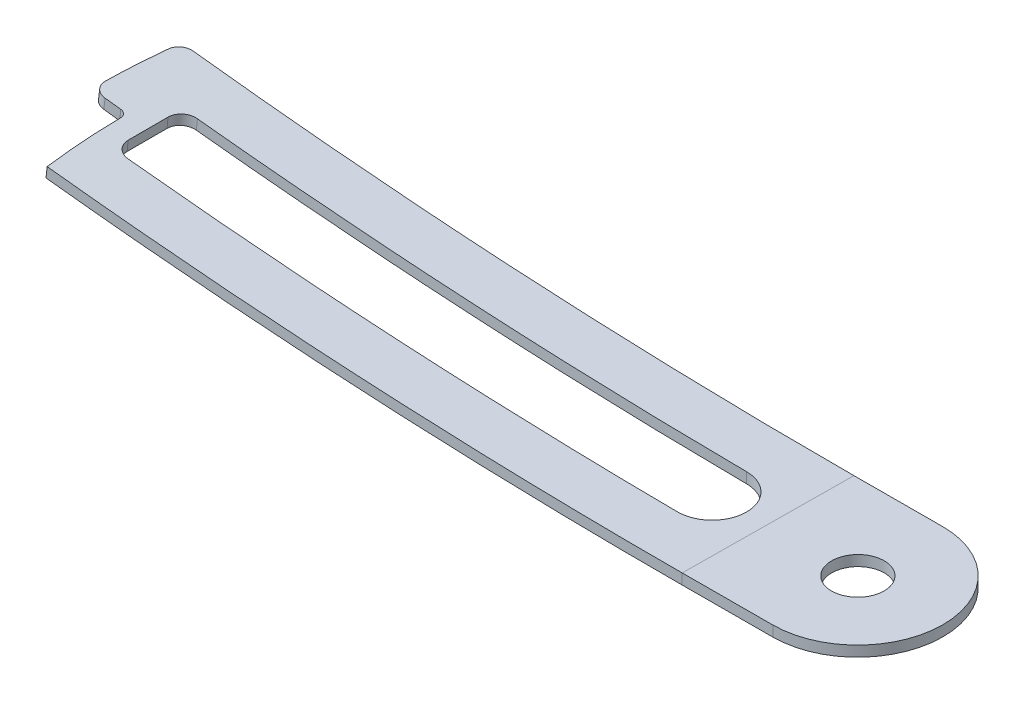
ISO-10303-21;
HEADER;
FILE_DESCRIPTION(('STEP AP214'),'2;1');
FILE_NAME('part.step','',(''),(''),'','','');
FILE_SCHEMA(('AUTOMOTIVE_DESIGN { 1 0 10303 214 1 1 1 1 }'));
ENDSEC;
DATA;
#1=APPLICATION_CONTEXT('core data for automotive mechanical design processes');
#2=APPLICATION_PROTOCOL_DEFINITION('international standard','automotive_design',2000,#1);
#3=PRODUCT_CONTEXT('',#1,'mechanical');
#4=PRODUCT('Part','Part','',(#3));
#5=PRODUCT_RELATED_PRODUCT_CATEGORY('part','',(#4));
#6=PRODUCT_DEFINITION_FORMATION('','',#4);
#7=PRODUCT_DEFINITION_CONTEXT('part definition',#1,'design');
#8=PRODUCT_DEFINITION('design','',#6,#7);
#9=PRODUCT_DEFINITION_SHAPE('','',#8);
#10=(LENGTH_UNIT() NAMED_UNIT(*) SI_UNIT(.MILLI.,.METRE.));
#11=(NAMED_UNIT(*) PLANE_ANGLE_UNIT() SI_UNIT($,.RADIAN.));
#12=(NAMED_UNIT(*) SI_UNIT($,.STERADIAN.) SOLID_ANGLE_UNIT());
#13=UNCERTAINTY_MEASURE_WITH_UNIT(LENGTH_MEASURE(1.E-05),#10,'distance_accuracy_value','');
#14=(GEOMETRIC_REPRESENTATION_CONTEXT(3) GLOBAL_UNCERTAINTY_ASSIGNED_CONTEXT((#13)) GLOBAL_UNIT_ASSIGNED_CONTEXT((#10,
#11,#12)) REPRESENTATION_CONTEXT('',''));
#15=CARTESIAN_POINT('',(0.,0.,0.));
#16=DIRECTION('',(0.,0.,1.));
#17=DIRECTION('',(1.,0.,0.));
#18=AXIS2_PLACEMENT_3D('',#15,#16,#17);
#19=CARTESIAN_POINT('',(-44.513273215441,3.25590333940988,0.398666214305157));
#20=DIRECTION('',(-0.112361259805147,-0.993666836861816,-0.00107917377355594));
#21=DIRECTION('',(0.993667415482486,-0.112361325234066,0.));
#22=AXIS2_PLACEMENT_3D('',#19,#20,#21);
#23=CYLINDRICAL_SURFACE('',#22,0.396678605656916);
#24=CARTESIAN_POINT('',(-44.6363227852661,2.16800324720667,0.000805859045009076));
#25=CARTESIAN_POINT('',(-44.614149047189,2.16548388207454,0.000785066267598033));
#26=CARTESIAN_POINT('',(-44.5919807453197,2.16296542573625,0.00268426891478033));
#27=CARTESIAN_POINT('',(-44.5482877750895,2.15800176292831,0.0101828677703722));
#28=CARTESIAN_POINT('',(-44.5267626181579,2.15555650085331,0.0157793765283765));
#29=CARTESIAN_POINT('',(-44.4849421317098,2.15080536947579,0.0305367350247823));
#30=CARTESIAN_POINT('',(-44.4646473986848,2.14849956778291,0.0396992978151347));
#31=CARTESIAN_POINT('',(-44.4258778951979,2.14409356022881,0.061320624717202));
#32=CARTESIAN_POINT('',(-44.4074027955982,2.14199331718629,0.0737787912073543));
#33=CARTESIAN_POINT('',(-44.3727933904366,2.13805661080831,0.101639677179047));
#34=CARTESIAN_POINT('',(-44.3566590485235,2.13622014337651,0.117042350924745));
#35=CARTESIAN_POINT('',(-44.3271855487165,2.13286158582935,0.150359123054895));
#36=CARTESIAN_POINT('',(-44.3138469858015,2.13133956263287,0.168273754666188));
#37=CARTESIAN_POINT('',(-44.2903460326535,2.12865228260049,0.206104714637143));
#38=CARTESIAN_POINT('',(-44.280184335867,2.1274871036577,0.226021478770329));
#39=CARTESIAN_POINT('',(-44.2633339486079,2.12554661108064,0.267284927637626));
#40=CARTESIAN_POINT('',(-44.2566430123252,2.1247710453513,0.288630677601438));
#41=CARTESIAN_POINT('',(-44.2487072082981,2.12384031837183,0.32412124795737));
#42=CARTESIAN_POINT('',(-44.2463644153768,2.12356188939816,0.338027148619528));
#43=CARTESIAN_POINT('',(-44.2431613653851,2.12317158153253,0.365989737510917));
#44=CARTESIAN_POINT('',(-44.2422988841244,2.1230594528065,0.380046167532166));
#45=CARTESIAN_POINT('',(-44.2421832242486,2.12303124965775,0.394115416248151));
#46=B_SPLINE_CURVE_WITH_KNOTS('',3,(#24,#25,#26,#27,#28,#29,#30,#31,#32,#33,#34,#35,#36,#37,#38,
#39,#40,#41,#42,#43,#44,#45),.UNSPECIFIED.,.F.,.F.,(4,2,2,2,2,2,2,2,2,2,4),(0.,
0.0668602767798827,0.133668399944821,0.200508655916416,0.2673367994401,0.334163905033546,
0.401005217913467,0.467861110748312,0.534673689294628,0.576913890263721,0.619090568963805),.UNSPECIFIED.);
#47=CARTESIAN_POINT('',(-44.6363227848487,2.16800325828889,0.000795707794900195));
#48=VERTEX_POINT('',#47);
#49=CARTESIAN_POINT('',(-44.2418412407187,2.12299318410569,0.39411249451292));
#50=VERTEX_POINT('',#49);
#51=EDGE_CURVE('E1152',#48,#50,#46,.T.);
#52=ORIENTED_EDGE('',*,*,#51,.T.);
#53=CARTESIAN_POINT('',(-44.1715161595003,2.75408586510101,0.394799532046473));
#54=CARTESIAN_POINT('',(-44.174434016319,2.72778895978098,0.394770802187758));
#55=CARTESIAN_POINT('',(-44.1773518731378,2.70149205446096,0.394742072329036));
#56=CARTESIAN_POINT('',(-44.1831875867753,2.6488982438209,0.394684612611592));
#57=CARTESIAN_POINT('',(-44.186105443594,2.62260133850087,0.39465588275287));
#58=CARTESIAN_POINT('',(-44.1919411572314,2.5700075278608,0.394598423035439));
#59=CARTESIAN_POINT('',(-44.1948590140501,2.54371062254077,0.394569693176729));
#60=CARTESIAN_POINT('',(-44.2006947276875,2.4911168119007,0.394512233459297));
#61=CARTESIAN_POINT('',(-44.2036125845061,2.46481990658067,0.394483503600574));
#62=CARTESIAN_POINT('',(-44.2094482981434,2.41222609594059,0.394426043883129));
#63=CARTESIAN_POINT('',(-44.2123661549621,2.38592919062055,0.394397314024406));
#64=CARTESIAN_POINT('',(-44.2182018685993,2.33333537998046,0.394339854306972));
#65=CARTESIAN_POINT('',(-44.2211197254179,2.30703847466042,0.394311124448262));
#66=CARTESIAN_POINT('',(-44.226955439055,2.25444466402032,0.394253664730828));
#67=CARTESIAN_POINT('',(-44.2298732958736,2.22814775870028,0.394224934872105));
#68=CARTESIAN_POINT('',(-44.2357090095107,2.17555394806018,0.394167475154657));
#69=CARTESIAN_POINT('',(-44.2386268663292,2.14925704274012,0.394138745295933));
#70=CARTESIAN_POINT('',(-44.2415447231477,2.12296013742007,0.394110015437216));
#71=B_SPLINE_CURVE_WITH_KNOTS('',3,(#53,#54,#55,#56,#57,#58,#59,#60,#61,#62,#63,#64,#65,#66,#67,
#68,#69,#70),.UNSPECIFIED.,.F.,.F.,(4,2,2,2,2,2,2,2,4),(0.,0.0793749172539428,0.158749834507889,
0.238124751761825,0.317499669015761,0.396874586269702,0.476249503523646,0.555624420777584,
0.634999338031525),.UNSPECIFIED.);
#72=CARTESIAN_POINT('',(-44.1711980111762,2.75405037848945,0.394796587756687));
#73=VERTEX_POINT('',#72);
#74=EDGE_CURVE('E704',#73,#50,#71,.T.);
#75=ORIENTED_EDGE('',*,*,#74,.F.);
#76=CARTESIAN_POINT('',(-44.564637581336,2.79894362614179,0.00149125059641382));
#77=CARTESIAN_POINT('',(-44.5424638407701,2.79642423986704,0.00148947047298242));
#78=CARTESIAN_POINT('',(-44.520297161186,2.79390595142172,0.00340767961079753));
#79=CARTESIAN_POINT('',(-44.4766105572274,2.78894298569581,0.0109437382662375));
#80=CARTESIAN_POINT('',(-44.455090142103,2.78649825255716,0.0165587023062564));
#81=CARTESIAN_POINT('',(-44.4132821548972,2.78174852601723,0.0313519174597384));
#82=CARTESIAN_POINT('',(-44.39299518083,2.77944360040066,0.0405318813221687));
#83=CARTESIAN_POINT('',(-44.3542439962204,2.77503966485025,0.0621864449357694));
#84=CARTESIAN_POINT('',(-44.3357794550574,2.772940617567,0.0746604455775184));
#85=CARTESIAN_POINT('',(-44.3011936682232,2.76900658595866,0.102550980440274));
#86=CARTESIAN_POINT('',(-44.2850723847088,2.76717159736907,0.117967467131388));
#87=CARTESIAN_POINT('',(-44.2556270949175,2.76381623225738,0.15130949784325));
#88=CARTESIAN_POINT('',(-44.2423036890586,2.76229592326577,0.169235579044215));
#89=CARTESIAN_POINT('',(-44.2188347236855,2.75961225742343,0.207086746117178));
#90=CARTESIAN_POINT('',(-44.2086898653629,2.75844897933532,0.227012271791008));
#91=CARTESIAN_POINT('',(-44.1918744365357,2.75651242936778,0.268290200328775));
#92=CARTESIAN_POINT('',(-44.1852015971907,2.75573890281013,0.28964166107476));
#93=CARTESIAN_POINT('',(-44.1773083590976,2.75481302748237,0.325082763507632));
#94=CARTESIAN_POINT('',(-44.1749838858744,2.75453672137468,0.338933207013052));
#95=CARTESIAN_POINT('',(-44.1718054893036,2.75414931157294,0.366782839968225));
#96=CARTESIAN_POINT('',(-44.1709493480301,2.75403795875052,0.380781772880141));
#97=CARTESIAN_POINT('',(-44.170833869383,2.75400983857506,0.394793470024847));
#98=B_SPLINE_CURVE_WITH_KNOTS('',3,(#76,#77,#78,#79,#80,#81,#82,#83,#84,#85,#86,#87,#88,#89,#90,
#91,#92,#93,#94,#95,#96,#97),.UNSPECIFIED.,.F.,.F.,(4,2,2,2,2,2,2,2,2,2,4),(0.,
0.066860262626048,0.133668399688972,0.200508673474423,0.267336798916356,0.334163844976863,
0.401005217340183,0.467861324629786,0.534673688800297,0.57674158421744,0.618745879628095),.UNSPECIFIED.);
#99=CARTESIAN_POINT('',(-44.5646375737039,2.79894363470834,0.0014826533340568));
#100=VERTEX_POINT('',#99);
#101=EDGE_CURVE('E698',#100,#73,#98,.T.);
#102=ORIENTED_EDGE('',*,*,#101,.F.);
#103=CARTESIAN_POINT('',(-44.6434911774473,2.10490921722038,0.000716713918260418));
#104=CARTESIAN_POINT('',(-44.6148170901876,2.35728536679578,0.000992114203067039));
#105=CARTESIAN_POINT('',(-44.5861430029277,2.60966151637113,0.00126751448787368));
#106=CARTESIAN_POINT('',(-44.5574689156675,2.86203766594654,0.0015429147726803));
#107=B_SPLINE_CURVE_WITH_KNOTS('',3,(#103,#104,#105,#106),.UNSPECIFIED.,.F.,.F.,(4,4),
(-0.0006985,6.35E-05),.UNSPECIFIED.);
#108=EDGE_CURVE('E1059',#100,#48,#107,.F.);
#109=ORIENTED_EDGE('',*,*,#108,.T.);
#110=EDGE_LOOP('',(#52,#75,#102,#109));
#111=FACE_BOUND('',#110,.T.);
#112=ADVANCED_FACE('F401',(#111),#23,.F.);
#113=CARTESIAN_POINT('',(-44.5477634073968,2.09404674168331,0.000710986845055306));
#114=CARTESIAN_POINT('',(-44.5191610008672,2.34643102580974,0.000985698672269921));
#115=CARTESIAN_POINT('',(-44.4905585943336,2.5988153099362,0.0012604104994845));
#116=CARTESIAN_POINT('',(-44.4619561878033,2.85119959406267,0.00153512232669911));
#117=CARTESIAN_POINT('',(-44.9306806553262,2.13744226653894,0.000733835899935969));
#118=CARTESIAN_POINT('',(-44.9017915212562,2.38979405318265,0.00101130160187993));
#119=CARTESIAN_POINT('',(-44.8729023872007,2.64214583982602,0.00128876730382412));
#120=CARTESIAN_POINT('',(-44.8440132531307,2.89449762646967,0.0015662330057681));
#121=CARTESIAN_POINT('',(-45.3135239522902,2.18149032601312,0.000757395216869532));
#122=CARTESIAN_POINT('',(-45.2843481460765,2.43380912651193,0.00103761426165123));
#123=CARTESIAN_POINT('',(-45.2551723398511,2.686127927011,0.00131783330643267));
#124=CARTESIAN_POINT('',(-45.2259965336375,2.93844672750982,0.0015980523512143));
#125=CARTESIAN_POINT('',(-45.6962910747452,2.22619066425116,0.00078168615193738));
#126=CARTESIAN_POINT('',(-45.6668286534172,2.47847599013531,0.00106465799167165));
#127=CARTESIAN_POINT('',(-45.6373662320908,2.73076131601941,0.00134762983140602));
#128=CARTESIAN_POINT('',(-45.6079038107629,2.98304664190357,0.00163060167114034));
#129=B_SPLINE_SURFACE_WITH_KNOTS('',3,3,((#113,#114,#115,#116),(#117,#118,#119,#120),(#121,#122,
#123,#124),(#125,#126,#127,#128)),.UNSPECIFIED.,.F.,.F.,.F.,(4,4),(4,4),(-0.00105956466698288,
9.63240606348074E-05),(-0.0006985,6.35E-05),.UNSPECIFIED.);
#130=CARTESIAN_POINT('',(-45.5932500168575,2.27810259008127,0.000846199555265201));
#131=CARTESIAN_POINT('',(-45.553384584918,2.27345849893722,0.000843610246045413));
#132=CARTESIAN_POINT('',(-45.5135183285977,2.26882148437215,0.000841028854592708));
#133=CARTESIAN_POINT('',(-45.4337841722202,2.25956160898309,0.000835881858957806));
#134=CARTESIAN_POINT('',(-45.3939162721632,2.25493874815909,0.000833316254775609));
#135=CARTESIAN_POINT('',(-45.3141788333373,2.24570718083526,0.00082820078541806));
#136=CARTESIAN_POINT('',(-45.2743092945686,2.24109847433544,0.000825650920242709));
#137=CARTESIAN_POINT('',(-45.1945685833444,2.23189521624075,0.000820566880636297));
#138=CARTESIAN_POINT('',(-45.1546974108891,2.22730066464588,0.000818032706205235));
#139=CARTESIAN_POINT('',(-45.0749534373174,2.21812571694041,0.000812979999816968));
#140=CARTESIAN_POINT('',(-45.0350806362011,2.21354532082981,0.000810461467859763));
#141=CARTESIAN_POINT('',(-44.9553334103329,2.20439868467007,0.000805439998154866));
#142=CARTESIAN_POINT('',(-44.915458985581,2.19983244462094,0.000802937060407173));
#143=CARTESIAN_POINT('',(-44.8357085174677,2.19071412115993,0.000797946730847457));
#144=CARTESIAN_POINT('',(-44.7958324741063,2.18616203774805,0.000795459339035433));
#145=CARTESIAN_POINT('',(-44.7160787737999,2.17707202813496,0.000790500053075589));
#146=CARTESIAN_POINT('',(-44.6762011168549,2.17253410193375,0.000788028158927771));
#147=CARTESIAN_POINT('',(-44.6363226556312,2.16800325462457,0.000785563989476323));
#148=B_SPLINE_CURVE_WITH_KNOTS('',3,(#130,#131,#132,#133,#134,#135,#136,#137,#138,#139,#140,
#141,#142,#143,#144,#145,#146,#147),.UNSPECIFIED.,.F.,.F.,(4,2,2,2,2,2,2,2,4),(0.,
0.12040507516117,0.240810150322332,0.361215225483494,0.481620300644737,0.602025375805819,
0.722430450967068,0.842835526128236,0.963240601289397),.UNSPECIFIED.);
#149=CARTESIAN_POINT('',(-45.5932510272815,2.27810272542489,0.000830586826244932));
#150=VERTEX_POINT('',#149);
#151=EDGE_CURVE('E1386',#150,#48,#148,.T.);
#152=CARTESIAN_POINT('',(-45.5197731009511,2.90883680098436,0.0015519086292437));
#153=CARTESIAN_POINT('',(-45.4799823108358,2.90420140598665,0.00154860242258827));
#154=CARTESIAN_POINT('',(-45.4401906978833,2.89957307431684,0.00154530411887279));
#155=CARTESIAN_POINT('',(-45.3606058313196,2.89033053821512,0.00153872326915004));
#156=CARTESIAN_POINT('',(-45.3208125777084,2.8857163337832,0.00153544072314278));
#157=CARTESIAN_POINT('',(-45.2412244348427,2.87650205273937,0.00152889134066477));
#158=CARTESIAN_POINT('',(-45.2014295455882,2.87190197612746,0.00152562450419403));
#159=CARTESIAN_POINT('',(-45.1218381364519,2.86271595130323,0.00151910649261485));
#160=CARTESIAN_POINT('',(-45.08204161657,2.85813000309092,0.00151585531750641));
#161=CARTESIAN_POINT('',(-45.0024469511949,2.84897223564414,0.00150936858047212));
#162=CARTESIAN_POINT('',(-44.9626488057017,2.84440041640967,0.00150613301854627));
#163=CARTESIAN_POINT('',(-44.88305089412,2.83527090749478,0.00149967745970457));
#164=CARTESIAN_POINT('',(-44.8432511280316,2.83071321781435,0.00149645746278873));
#165=CARTESIAN_POINT('',(-44.7636499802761,2.82161196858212,0.00149003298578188));
#166=CARTESIAN_POINT('',(-44.7238485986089,2.81706840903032,0.00148682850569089));
#167=CARTESIAN_POINT('',(-44.6442442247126,2.80799542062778,0.0014804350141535));
#168=CARTESIAN_POINT('',(-44.6044412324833,2.80346599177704,0.0014772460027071));
#169=CARTESIAN_POINT('',(-44.5646374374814,2.79894362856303,0.00147406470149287));
#170=B_SPLINE_CURVE_WITH_KNOTS('',3,(#152,#153,#154,#155,#156,#157,#158,#159,#160,#161,#162,
#163,#164,#165,#166,#167,#168,#169),.UNSPECIFIED.,.F.,.F.,(4,2,2,2,2,2,2,2,4),(0.,
0.120179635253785,0.240359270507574,0.360538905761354,0.480718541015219,0.600898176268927,
0.721077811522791,0.841257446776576,0.961437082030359),.UNSPECIFIED.);
#171=CARTESIAN_POINT('',(-45.5197741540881,2.90883693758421,0.00153957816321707));
#172=VERTEX_POINT('',#171);
#173=EDGE_CURVE('E700',#172,#100,#170,.T.);
#174=CARTESIAN_POINT('',(-45.5124254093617,2.9719102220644,0.00162247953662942));
#175=CARTESIAN_POINT('',(-45.5418161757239,2.71961653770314,0.00134019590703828));
#176=CARTESIAN_POINT('',(-45.5712069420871,2.46732285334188,0.00105791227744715));
#177=CARTESIAN_POINT('',(-45.6005977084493,2.21502916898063,0.000775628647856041));
#178=B_SPLINE_CURVE_WITH_KNOTS('',3,(#174,#175,#176,#177),.UNSPECIFIED.,.F.,.F.,(4,4),
(-0.0006985,6.35E-05),.UNSPECIFIED.);
#179=EDGE_CURVE('E1012',#172,#150,#178,.T.);
#180=ORIENTED_EDGE('',*,*,#151,.T.);
#181=ORIENTED_EDGE('',*,*,#108,.F.);
#182=ORIENTED_EDGE('',*,*,#173,.F.);
#183=ORIENTED_EDGE('',*,*,#179,.T.);
#184=EDGE_LOOP('',(#180,#181,#182,#183));
#185=FACE_BOUND('',#184,.T.);
#186=ADVANCED_FACE('F1030',(#185),#129,.F.);
#187=CARTESIAN_POINT('',(-45.4188998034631,3.76101184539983,-0.790887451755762));
#188=DIRECTION('',(-0.116808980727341,-0.993153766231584,-0.0011218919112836));
#189=DIRECTION('',(0.993154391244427,-0.116809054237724,0.));
#190=AXIS2_PLACEMENT_3D('',#187,#188,#189);
#191=CYLINDRICAL_SURFACE('',#190,0.793376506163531);
#192=CARTESIAN_POINT('',(-46.3068447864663,3.00238151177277,-0.805928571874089));
#193=CARTESIAN_POINT('',(-46.3099353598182,2.97610433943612,-0.805957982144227));
#194=CARTESIAN_POINT('',(-46.3130259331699,2.94982716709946,-0.805987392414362));
#195=CARTESIAN_POINT('',(-46.3192070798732,2.89727282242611,-0.806046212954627));
#196=CARTESIAN_POINT('',(-46.3222976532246,2.87099565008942,-0.806075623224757));
#197=CARTESIAN_POINT('',(-46.3284787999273,2.818441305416,-0.806134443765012));
#198=CARTESIAN_POINT('',(-46.3315693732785,2.79216413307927,-0.806163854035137));
#199=CARTESIAN_POINT('',(-46.3377505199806,2.73960978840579,-0.806222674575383));
#200=CARTESIAN_POINT('',(-46.3408410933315,2.71333261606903,-0.806252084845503));
#201=CARTESIAN_POINT('',(-46.3470222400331,2.66077827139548,-0.806310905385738));
#202=CARTESIAN_POINT('',(-46.3501128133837,2.63450109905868,-0.806340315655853));
#203=CARTESIAN_POINT('',(-46.3562939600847,2.58194675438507,-0.806399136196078));
#204=CARTESIAN_POINT('',(-46.359384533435,2.55566958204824,-0.806428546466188));
#205=CARTESIAN_POINT('',(-46.3655656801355,2.50311523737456,-0.806487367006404));
#206=CARTESIAN_POINT('',(-46.3686562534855,2.4768380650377,-0.806516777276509));
#207=CARTESIAN_POINT('',(-46.3748374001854,2.42428372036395,-0.806575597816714));
#208=CARTESIAN_POINT('',(-46.3779279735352,2.39800654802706,-0.806605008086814));
#209=CARTESIAN_POINT('',(-46.3810185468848,2.37172937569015,-0.806634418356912));
#210=B_SPLINE_CURVE_WITH_KNOTS('',3,(#192,#193,#194,#195,#196,#197,#198,#199,#200,#201,#202,
#203,#204,#205,#206,#207,#208,#209),.UNSPECIFIED.,.F.,.F.,(4,2,2,2,2,2,2,2,4),(0.,
0.0793749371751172,0.158749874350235,0.238124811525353,0.317499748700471,0.396874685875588,
0.476249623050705,0.555624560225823,0.634999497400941),.UNSPECIFIED.);
#211=CARTESIAN_POINT('',(-46.3066239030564,3.00235553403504,-0.80592479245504));
#212=VERTEX_POINT('',#211);
#213=CARTESIAN_POINT('',(-46.3812146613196,2.37175243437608,-0.806638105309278));
#214=VERTEX_POINT('',#213);
#215=EDGE_CURVE('E1001',#212,#214,#210,.T.);
#216=ORIENTED_EDGE('',*,*,#215,.T.);
#217=CARTESIAN_POINT('',(-46.3810185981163,2.37172891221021,-0.806634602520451));
#218=CARTESIAN_POINT('',(-46.3818483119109,2.37177685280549,-0.762008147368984));
#219=CARTESIAN_POINT('',(-46.3788652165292,2.37137092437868,-0.717324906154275));
#220=CARTESIAN_POINT('',(-46.3655283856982,2.36968490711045,-0.629123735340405));
#221=CARTESIAN_POINT('',(-46.3551804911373,2.3684055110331,-0.585604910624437));
#222=CARTESIAN_POINT('',(-46.3273628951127,2.36500529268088,-0.500916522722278));
#223=CARTESIAN_POINT('',(-46.30988978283,2.36288406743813,-0.459748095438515));
#224=CARTESIAN_POINT('',(-46.2683325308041,2.35786558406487,-0.380956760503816));
#225=CARTESIAN_POINT('',(-46.2442494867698,2.35496845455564,-0.343333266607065));
#226=CARTESIAN_POINT('',(-46.1901512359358,2.34848393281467,-0.272692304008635));
#227=CARTESIAN_POINT('',(-46.1601360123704,2.34489653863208,-0.239674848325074));
#228=CARTESIAN_POINT('',(-46.0950192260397,2.33713707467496,-0.179178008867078));
#229=CARTESIAN_POINT('',(-46.0599168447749,2.33296491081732,-0.151699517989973));
#230=CARTESIAN_POINT('',(-45.9856240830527,2.32415890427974,-0.103064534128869));
#231=CARTESIAN_POINT('',(-45.9464330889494,2.3195249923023,-0.081908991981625));
#232=CARTESIAN_POINT('',(-45.865082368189,2.30993155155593,-0.0465317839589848));
#233=CARTESIAN_POINT('',(-45.822924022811,2.3049721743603,-0.0323069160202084));
#234=CARTESIAN_POINT('',(-45.7493640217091,2.29634119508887,-0.0142538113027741));
#235=CARTESIAN_POINT('',(-45.7183907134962,2.29271348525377,-0.00860650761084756));
#236=CARTESIAN_POINT('',(-45.6560329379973,2.28542303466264,-0.00107038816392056));
#237=CARTESIAN_POINT('',(-45.6246490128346,2.28176034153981,0.000822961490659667));
#238=CARTESIAN_POINT('',(-45.5932510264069,2.27810274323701,0.000814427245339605));
#239=B_SPLINE_CURVE_WITH_KNOTS('',3,(#217,#218,#219,#220,#221,#222,#223,#224,#225,#226,#227,
#228,#229,#230,#231,#232,#233,#234,#235,#236,#237,#238),.UNSPECIFIED.,.F.,.F.,(4,2,2,2,2,2,2,2,
2,2,4),(0.,0.133724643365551,0.267343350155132,0.401026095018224,0.534686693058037,
0.668347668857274,0.802030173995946,0.935732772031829,1.06937353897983,1.1642363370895,
1.25898449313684),.UNSPECIFIED.);
#240=EDGE_CURVE('E1389',#214,#150,#239,.T.);
#241=ORIENTED_EDGE('',*,*,#240,.T.);
#242=ORIENTED_EDGE('',*,*,#179,.F.);
#243=CARTESIAN_POINT('',(-46.3068447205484,3.00238204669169,-0.805928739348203));
#244=CARTESIAN_POINT('',(-46.3076747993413,3.00243003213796,-0.761302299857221));
#245=CARTESIAN_POINT('',(-46.3046920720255,3.00202413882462,-0.716619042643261));
#246=CARTESIAN_POINT('',(-46.2913559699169,3.00033817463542,-0.628417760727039));
#247=CARTESIAN_POINT('',(-46.2810084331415,2.99905879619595,-0.584898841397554));
#248=CARTESIAN_POINT('',(-46.2531915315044,2.99565859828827,-0.500210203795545));
#249=CARTESIAN_POINT('',(-46.2357187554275,2.99353737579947,-0.459041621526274));
#250=CARTESIAN_POINT('',(-46.1941621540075,2.98851889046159,-0.380249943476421));
#251=CARTESIAN_POINT('',(-46.1700794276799,2.98562175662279,-0.342626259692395));
#252=CARTESIAN_POINT('',(-46.1159817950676,2.97913722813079,-0.271984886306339));
#253=CARTESIAN_POINT('',(-46.0859668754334,2.97554983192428,-0.238967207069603));
#254=CARTESIAN_POINT('',(-46.0208505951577,2.96779036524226,-0.17846981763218));
#255=CARTESIAN_POINT('',(-45.9857484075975,2.96361819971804,-0.150991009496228));
#256=CARTESIAN_POINT('',(-45.9114559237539,2.95481219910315,-0.102355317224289));
#257=CARTESIAN_POINT('',(-45.872265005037,2.95017829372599,-0.0811993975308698));
#258=CARTESIAN_POINT('',(-45.7909144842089,2.94058490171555,-0.045821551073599));
#259=CARTESIAN_POINT('',(-45.7487562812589,2.93562556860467,-0.0315963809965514));
#260=CARTESIAN_POINT('',(-45.6753083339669,2.9270078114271,-0.0135700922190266));
#261=CARTESIAN_POINT('',(-45.6444500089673,2.92339358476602,-0.00793645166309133));
#262=CARTESIAN_POINT('',(-45.5823240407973,2.91613023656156,-0.000400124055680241));
#263=CARTESIAN_POINT('',(-45.5510569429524,2.91248116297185,0.00150710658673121));
#264=CARTESIAN_POINT('',(-45.5197741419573,2.90883695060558,0.0015265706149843));
#265=B_SPLINE_CURVE_WITH_KNOTS('',3,(#243,#244,#245,#246,#247,#248,#249,#250,#251,#252,#253,
#254,#255,#256,#257,#258,#259,#260,#261,#262,#263,#264),.UNSPECIFIED.,.F.,.F.,(4,2,2,2,2,2,2,2,
2,2,4),(0.,0.133724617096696,0.267343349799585,0.401026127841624,0.534686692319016,
0.668347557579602,0.80203017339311,0.935733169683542,1.0693735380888,1.16388977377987,
1.25829069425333),.UNSPECIFIED.);
#266=EDGE_CURVE('E1150',#212,#172,#265,.T.);
#267=ORIENTED_EDGE('',*,*,#266,.F.);
#268=EDGE_LOOP('',(#216,#241,#242,#267));
#269=FACE_BOUND('',#268,.T.);
#270=ADVANCED_FACE('F982',(#269),#191,.T.);
#271=CARTESIAN_POINT('',(5.35460756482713,43.811862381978,0.0514190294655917));
#272=DIRECTION('',(-0.117294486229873,-0.993096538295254,-0.00112655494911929));
#273=DIRECTION('',(0.993097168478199,-0.117294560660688,0.));
#274=AXIS2_PLACEMENT_3D('',#271,#272,#273);
#275=CYLINDRICAL_SURFACE('',#274,46.5248913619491);
#276=CARTESIAN_POINT('',(-46.1038777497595,2.98242484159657,-4.42372242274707));
#277=CARTESIAN_POINT('',(-46.1069812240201,2.95614916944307,-4.42375162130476));
#278=CARTESIAN_POINT('',(-46.1100846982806,2.92987349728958,-4.42378081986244));
#279=CARTESIAN_POINT('',(-46.1162916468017,2.87732215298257,-4.42383921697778));
#280=CARTESIAN_POINT('',(-46.1193951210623,2.85104648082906,-4.42386841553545));
#281=CARTESIAN_POINT('',(-46.1256020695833,2.79849513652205,-4.42392681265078));
#282=CARTESIAN_POINT('',(-46.1287055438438,2.77221946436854,-4.42395601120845));
#283=CARTESIAN_POINT('',(-46.1349124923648,2.71966812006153,-4.42401440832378));
#284=CARTESIAN_POINT('',(-46.1380159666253,2.69339244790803,-4.42404360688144));
#285=CARTESIAN_POINT('',(-46.1442229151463,2.64084110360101,-4.42410200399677));
#286=CARTESIAN_POINT('',(-46.1473263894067,2.6145654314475,-4.42413120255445));
#287=CARTESIAN_POINT('',(-46.1535333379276,2.56201408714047,-4.42418959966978));
#288=CARTESIAN_POINT('',(-46.1566368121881,2.53573841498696,-4.42421879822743));
#289=CARTESIAN_POINT('',(-46.1628437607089,2.48318707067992,-4.42427719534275));
#290=CARTESIAN_POINT('',(-46.1659472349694,2.45691139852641,-4.4243063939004));
#291=CARTESIAN_POINT('',(-46.1721541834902,2.40436005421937,-4.42436479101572));
#292=CARTESIAN_POINT('',(-46.1752576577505,2.37808438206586,-4.42439398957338));
#293=CARTESIAN_POINT('',(-46.1783611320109,2.35180870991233,-4.42442318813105));
#294=B_SPLINE_CURVE_WITH_KNOTS('',3,(#276,#277,#278,#279,#280,#281,#282,#283,#284,#285,#286,
#287,#288,#289,#290,#291,#292,#293),.UNSPECIFIED.,.F.,.F.,(4,2,2,2,2,2,2,2,4),(0.,
0.0793749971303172,0.15874999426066,0.238124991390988,0.317499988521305,0.39687498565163,
0.476249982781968,0.555624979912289,0.634999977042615),.UNSPECIFIED.);
#295=CARTESIAN_POINT('',(-46.1040234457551,2.98244184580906,-4.42373663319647));
#296=VERTEX_POINT('',#295);
#297=CARTESIAN_POINT('',(-46.1782495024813,2.35179570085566,-4.42441282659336));
#298=VERTEX_POINT('',#297);
#299=EDGE_CURVE('E957',#296,#298,#294,.T.);
#300=ORIENTED_EDGE('',*,*,#299,.T.);
#301=CARTESIAN_POINT('',(-46.1783610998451,2.35180868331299,-4.42442355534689));
#302=CARTESIAN_POINT('',(-46.2354847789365,2.35789423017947,-3.8227818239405));
#303=CARTESIAN_POINT('',(-46.2809452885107,2.3625982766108,-3.22047873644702));
#304=CARTESIAN_POINT('',(-46.3485399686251,2.3692433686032,-2.01454984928));
#305=CARTESIAN_POINT('',(-46.370674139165,2.37118441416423,-1.41092404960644));
#306=CARTESIAN_POINT('',(-46.3811451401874,2.37174395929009,-0.806636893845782));
#307=B_SPLINE_CURVE_WITH_KNOTS('',3,(#301,#302,#303,#304,#305,#306),.UNSPECIFIED.,.F.,.F.,(4,2,
4),(0.,1.81210379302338,3.62420758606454),.UNSPECIFIED.);
#308=EDGE_CURVE('E1400',#298,#214,#307,.T.);
#309=ORIENTED_EDGE('',*,*,#308,.T.);
#310=ORIENTED_EDGE('',*,*,#215,.F.);
#311=CARTESIAN_POINT('',(-46.1038777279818,2.98242486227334,-4.42372262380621));
#312=CARTESIAN_POINT('',(-46.1610017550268,2.98851048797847,-3.82207915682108));
#313=CARTESIAN_POINT('',(-46.2064625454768,2.99321459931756,-3.21977432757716));
#314=CARTESIAN_POINT('',(-46.2740576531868,2.99985979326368,-2.01384194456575));
#315=CARTESIAN_POINT('',(-46.2961919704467,3.00180087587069,-1.41021439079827));
#316=CARTESIAN_POINT('',(-46.3066630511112,3.00236044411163,-0.805925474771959));
#317=B_SPLINE_CURVE_WITH_KNOTS('',3,(#311,#312,#313,#314,#315,#316),.UNSPECIFIED.,.F.,.F.,(4,2,
4),(0.,1.81210906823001,3.62421813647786),.UNSPECIFIED.);
#318=EDGE_CURVE('E1148',#296,#212,#317,.T.);
#319=ORIENTED_EDGE('',*,*,#318,.F.);
#320=EDGE_LOOP('',(#300,#309,#310,#319));
#321=FACE_BOUND('',#320,.T.);
#322=ADVANCED_FACE('F974',(#321),#275,.T.);
#323=CARTESIAN_POINT('',(-45.220200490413,3.74151946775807,-4.34765307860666));
#324=DIRECTION('',(-0.116295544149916,-0.993214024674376,-0.00111696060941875));
#325=DIRECTION('',(0.993214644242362,-0.116295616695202,0.));
#326=AXIS2_PLACEMENT_3D('',#323,#324,#325);
#327=CYLINDRICAL_SURFACE('',#326,0.793318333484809);
#328=CARTESIAN_POINT('',(-45.3936271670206,2.26063653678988,-5.14266442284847));
#329=CARTESIAN_POINT('',(-45.3905772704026,2.28691848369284,-5.14263562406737));
#330=CARTESIAN_POINT('',(-45.3875273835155,2.31320043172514,-5.14260682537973));
#331=CARTESIAN_POINT('',(-45.3814276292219,2.36576432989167,-5.14254922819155));
#332=CARTESIAN_POINT('',(-45.3783777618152,2.39204628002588,-5.14252042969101));
#333=CARTESIAN_POINT('',(-45.3722780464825,2.44461018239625,-5.14246283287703));
#334=CARTESIAN_POINT('',(-45.3692281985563,2.4708921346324,-5.1424340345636));
#335=CARTESIAN_POINT('',(-45.3631285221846,2.52345604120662,-5.14237643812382));
#336=CARTESIAN_POINT('',(-45.3600786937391,2.5497379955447,-5.14234763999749));
#337=CARTESIAN_POINT('',(-45.3539790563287,2.60230190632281,-5.14229004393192));
#338=CARTESIAN_POINT('',(-45.3509292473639,2.62858386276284,-5.14226124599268));
#339=CARTESIAN_POINT('',(-45.3448296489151,2.68114777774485,-5.14220365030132));
#340=CARTESIAN_POINT('',(-45.3417798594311,2.70742973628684,-5.14217485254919));
#341=CARTESIAN_POINT('',(-45.3356802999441,2.75999365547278,-5.14211725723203));
#342=CARTESIAN_POINT('',(-45.3326305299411,2.78627561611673,-5.14208845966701));
#343=CARTESIAN_POINT('',(-45.326531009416,2.83883953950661,-5.14203086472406));
#344=CARTESIAN_POINT('',(-45.323481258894,2.86512150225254,-5.14200206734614));
#345=CARTESIAN_POINT('',(-45.3204315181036,2.89140346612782,-5.14197327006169));
#346=B_SPLINE_CURVE_WITH_KNOTS('',3,(#328,#329,#330,#331,#332,#333,#334,#335,#336,#337,#338,
#339,#340,#341,#342,#343,#344,#345),.UNSPECIFIED.,.F.,.F.,(4,2,2,2,2,2,2,2,4),(0.,
0.079375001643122,0.158750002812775,0.238125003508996,0.317500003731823,0.396875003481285,
0.476250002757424,0.555625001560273,0.634999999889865),.UNSPECIFIED.);
#347=CARTESIAN_POINT('',(-45.3204313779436,2.89140342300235,-5.14194887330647));
#348=VERTEX_POINT('',#347);
#349=CARTESIAN_POINT('',(-45.393627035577,2.26063650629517,-5.14265064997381));
#350=VERTEX_POINT('',#349);
#351=EDGE_CURVE('E945',#348,#350,#346,.F.);
#352=ORIENTED_EDGE('',*,*,#351,.T.);
#353=CARTESIAN_POINT('',(-45.3936270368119,2.26063649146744,-5.14263729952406));
#354=CARTESIAN_POINT('',(-45.4379590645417,2.26578058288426,-5.14267359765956));
#355=CARTESIAN_POINT('',(-45.4822791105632,2.27092854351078,-5.13887028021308));
#356=CARTESIAN_POINT('',(-45.5696326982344,2.28108340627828,-5.12386377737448));
#357=CARTESIAN_POINT('',(-45.6126671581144,2.28609040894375,-5.11266601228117));
#358=CARTESIAN_POINT('',(-45.6962759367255,2.29582488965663,-5.08314202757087));
#359=CARTESIAN_POINT('',(-45.736849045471,2.3005522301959,-5.06481233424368));
#360=CARTESIAN_POINT('',(-45.8143531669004,2.30958617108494,-5.02156219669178));
#361=CARTESIAN_POINT('',(-45.8512850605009,2.3138928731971,-4.99664335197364));
#362=CARTESIAN_POINT('',(-45.9204667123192,2.32196009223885,-4.94091998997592));
#363=CARTESIAN_POINT('',(-45.9527168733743,2.32572065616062,-4.91011597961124));
#364=CARTESIAN_POINT('',(-46.0116370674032,2.33258638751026,-4.84347930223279));
#365=CARTESIAN_POINT('',(-46.0383047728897,2.33569128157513,-4.80764454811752));
#366=CARTESIAN_POINT('',(-46.0852962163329,2.34115245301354,-4.73196488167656));
#367=CARTESIAN_POINT('',(-46.1056168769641,2.3435083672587,-4.69211803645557));
#368=CARTESIAN_POINT('',(-46.1393013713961,2.34739687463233,-4.60958211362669));
#369=CARTESIAN_POINT('',(-46.1526747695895,2.34893059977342,-4.5668970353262));
#370=CARTESIAN_POINT('',(-46.1660449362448,2.35044484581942,-4.50710173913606));
#371=CARTESIAN_POINT('',(-46.1691812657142,2.35079735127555,-4.49065482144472));
#372=CARTESIAN_POINT('',(-46.1744103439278,2.35137873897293,-4.45762302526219));
#373=CARTESIAN_POINT('',(-46.1765048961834,2.35160783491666,-4.4410384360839));
#374=CARTESIAN_POINT('',(-46.1780790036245,2.35177525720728,-4.42439650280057));
#375=B_SPLINE_CURVE_WITH_KNOTS('',3,(#353,#354,#355,#356,#357,#358,#359,#360,#361,#362,#363,
#364,#365,#366,#367,#368,#369,#370,#371,#372,#373,#374),.UNSPECIFIED.,.F.,.F.,(4,2,2,2,2,2,2,2,
2,2,4),(0.,0.133710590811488,0.267323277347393,0.401001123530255,0.53464654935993,
0.668280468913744,0.801969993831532,0.935724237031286,1.06929384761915,1.11950894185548,
1.16963679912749),.UNSPECIFIED.);
#376=EDGE_CURVE('E1324',#350,#298,#375,.T.);
#377=ORIENTED_EDGE('',*,*,#376,.T.);
#378=ORIENTED_EDGE('',*,*,#299,.F.);
#379=CARTESIAN_POINT('',(-45.320431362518,2.89140339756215,-5.14192773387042));
#380=CARTESIAN_POINT('',(-45.3647633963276,2.89654744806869,-5.14192710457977));
#381=CARTESIAN_POINT('',(-45.4090802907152,2.90169501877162,-5.13808687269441));
#382=CARTESIAN_POINT('',(-45.4964215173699,2.91184842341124,-5.12300761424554));
#383=CARTESIAN_POINT('',(-45.5394467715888,2.91685435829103,-5.11177400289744));
#384=CARTESIAN_POINT('',(-45.6230312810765,2.92658603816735,-5.08218037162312));
#385=CARTESIAN_POINT('',(-45.6635893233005,2.93131164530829,-5.06381687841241));
#386=CARTESIAN_POINT('',(-45.7410578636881,2.94034148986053,-5.0205021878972));
#387=CARTESIAN_POINT('',(-45.7779692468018,2.9446458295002,-4.99555259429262));
#388=CARTESIAN_POINT('',(-45.8471050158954,2.95270775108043,-4.93977166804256));
#389=CARTESIAN_POINT('',(-45.8793298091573,2.95646538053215,-4.90894084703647));
#390=CARTESIAN_POINT('',(-45.9381952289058,2.96332475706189,-4.84225511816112));
#391=CARTESIAN_POINT('',(-45.9648335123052,2.96642622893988,-4.80639811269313));
#392=CARTESIAN_POINT('',(-46.0117628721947,2.97188015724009,-4.73067913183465));
#393=CARTESIAN_POINT('',(-46.0320508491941,2.97423224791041,-4.69081521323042));
#394=CARTESIAN_POINT('',(-46.0656674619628,2.97811279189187,-4.6082511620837));
#395=CARTESIAN_POINT('',(-46.0790057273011,2.97964238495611,-4.56555504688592));
#396=CARTESIAN_POINT('',(-46.0923003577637,2.98114784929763,-4.50586712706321));
#397=CARTESIAN_POINT('',(-46.095404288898,2.98149666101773,-4.48953735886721));
#398=CARTESIAN_POINT('',(-46.1005835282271,2.98207243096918,-4.45674237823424));
#399=CARTESIAN_POINT('',(-46.1026606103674,2.98229959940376,-4.44027744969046));
#400=CARTESIAN_POINT('',(-46.1042247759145,2.9824659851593,-4.42375592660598));
#401=B_SPLINE_CURVE_WITH_KNOTS('',3,(#379,#380,#381,#382,#383,#384,#385,#386,#387,#388,#389,
#390,#391,#392,#393,#394,#395,#396,#397,#398,#399,#400),.UNSPECIFIED.,.F.,.F.,(4,2,2,2,2,2,2,2,
2,2,4),(0.,0.133710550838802,0.267323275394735,0.401001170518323,0.53464654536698,
0.6682802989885,0.801969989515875,0.935724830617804,1.06929384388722,1.11914600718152,
1.16891174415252),.UNSPECIFIED.);
#402=EDGE_CURVE('E1147',#348,#296,#401,.T.);
#403=ORIENTED_EDGE('',*,*,#402,.F.);
#404=EDGE_LOOP('',(#352,#377,#378,#403));
#405=FACE_BOUND('',#404,.T.);
#406=ADVANCED_FACE('F926',(#405),#327,.T.);
#407=CARTESIAN_POINT('',(-5.49258671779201,-0.0623619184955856,2.09550156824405));
#408=CARTESIAN_POINT('',(-5.49324381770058,0.191637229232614,2.09549525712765));
#409=CARTESIAN_POINT('',(-5.49390091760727,0.445636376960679,2.09548894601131));
#410=CARTESIAN_POINT('',(-5.49455801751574,0.699635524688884,2.09548263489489));
#411=CARTESIAN_POINT('',(-12.161312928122,-0.0796368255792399,2.09548979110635));
#412=CARTESIAN_POINT('',(-12.1569764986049,0.174375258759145,2.09553144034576));
#413=CARTESIAN_POINT('',(-12.1526400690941,0.428387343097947,2.09557308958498));
#414=CARTESIAN_POINT('',(-12.1483036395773,0.682399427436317,2.09561473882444));
#415=CARTESIAN_POINT('',(-25.4997805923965,0.279320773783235,2.09545648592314));
#416=CARTESIAN_POINT('',(-25.4854563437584,0.533064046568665,2.09559406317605));
#417=CARTESIAN_POINT('',(-25.4711320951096,0.786807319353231,2.09573164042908));
#418=CARTESIAN_POINT('',(-25.4568078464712,1.04055059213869,2.09586921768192));
#419=CARTESIAN_POINT('',(-38.7939031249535,1.42381897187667,2.09584909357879));
#420=CARTESIAN_POINT('',(-38.7696242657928,1.67670516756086,2.09608227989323));
#421=CARTESIAN_POINT('',(-38.7453454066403,1.92959136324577,2.09631546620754));
#422=CARTESIAN_POINT('',(-38.7210665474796,2.18247755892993,2.09654865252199));
#423=CARTESIAN_POINT('',(-45.418316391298,2.19151448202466,2.09626292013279));
#424=CARTESIAN_POINT('',(-45.3890771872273,2.44382577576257,2.09654374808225));
#425=CARTESIAN_POINT('',(-45.3598379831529,2.69613706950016,2.09682457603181));
#426=CARTESIAN_POINT('',(-45.3305987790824,2.9484483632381,2.09710540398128));
#427=B_SPLINE_SURFACE_WITH_KNOTS('',3,3,((#407,#408,#409,#410),(#411,#412,#413,#414),(#415,#416,
#417,#418),(#419,#420,#421,#422),(#423,#424,#425,#426)),.UNSPECIFIED.,.F.,.F.,.F.,(4,1,4),(4,4),
(-0.03667125,-0.01666875,0.00333375),(-0.0006985,6.35E-05),.UNSPECIFIED.);
#428=CARTESIAN_POINT('',(-42.0975863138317,1.88710697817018,2.09613787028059));
#429=CARTESIAN_POINT('',(-40.7162529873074,1.74077557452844,2.09606363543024));
#430=CARTESIAN_POINT('',(-39.3340205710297,1.60293147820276,2.09599803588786));
#431=CARTESIAN_POINT('',(-36.5679664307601,1.34423669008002,2.09588210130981));
#432=CARTESIAN_POINT('',(-35.1841447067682,1.22338599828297,2.09583176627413));
#433=CARTESIAN_POINT('',(-32.4151208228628,0.998696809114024,2.09574435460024));
#434=CARTESIAN_POINT('',(-31.0299186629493,0.894858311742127,2.09570727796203));
#435=CARTESIAN_POINT('',(-28.2583430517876,0.704209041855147,2.0956443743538));
#436=CARTESIAN_POINT('',(-26.8719696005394,0.617398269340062,2.09561854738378));
#437=CARTESIAN_POINT('',(-24.0982607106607,0.460817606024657,2.09557613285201));
#438=CARTESIAN_POINT('',(-22.7109252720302,0.391047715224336,2.09555954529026));
#439=CARTESIAN_POINT('',(-19.9355018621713,0.268559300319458,2.09553359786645));
#440=CARTESIAN_POINT('',(-18.547413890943,0.2158407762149,2.0955242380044));
#441=CARTESIAN_POINT('',(-15.7706949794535,0.127463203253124,2.09551073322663));
#442=CARTESIAN_POINT('',(-14.3820640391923,0.0918041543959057,2.09550658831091));
#443=CARTESIAN_POINT('',(-11.6044688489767,0.0375503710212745,2.09550149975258));
#444=CARTESIAN_POINT('',(-10.2155045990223,0.0189556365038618,2.09550055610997));
#445=CARTESIAN_POINT('',(-8.82647852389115,0.00889547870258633,2.0955002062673));
#446=B_SPLINE_CURVE_WITH_KNOTS('',3,(#428,#429,#430,#431,#432,#433,#434,#435,#436,#437,#438,
#439,#440,#441,#442,#443,#444,#445),.UNSPECIFIED.,.F.,.F.,(4,2,2,2,2,2,2,2,4),(0.,
4.16716128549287,8.33432257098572,12.5014838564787,16.6686451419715,20.8358064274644,
25.0029677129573,29.1701289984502,33.337290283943),.UNSPECIFIED.);
#447=CARTESIAN_POINT('',(-42.0975874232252,1.88710711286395,2.09612118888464));
#448=VERTEX_POINT('',#447);
#449=CARTESIAN_POINT('',(-8.82647861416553,0.00889548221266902,2.09545424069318));
#450=VERTEX_POINT('',#449);
#451=EDGE_CURVE('E1358',#448,#450,#446,.T.);
#452=CARTESIAN_POINT('',(-42.1042759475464,1.82395827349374,2.09607361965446));
#453=CARTESIAN_POINT('',(-42.0775182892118,2.07654481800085,2.09633061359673));
#454=CARTESIAN_POINT('',(-42.0507606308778,2.32913136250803,2.09658760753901));
#455=CARTESIAN_POINT('',(-42.0240029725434,2.58171790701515,2.09684460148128));
#456=B_SPLINE_CURVE_WITH_KNOTS('',3,(#452,#453,#454,#455),.UNSPECIFIED.,.F.,.F.,(4,4),
(-0.0006985,6.35E-05),.UNSPECIFIED.);
#457=CARTESIAN_POINT('',(-42.0306933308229,2.51857347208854,2.09676733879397));
#458=VERTEX_POINT('',#457);
#459=EDGE_CURVE('E774',#458,#448,#456,.F.);
#460=CARTESIAN_POINT('',(-42.0306921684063,2.5185733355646,2.09678035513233));
#461=CARTESIAN_POINT('',(-40.6519451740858,2.37251594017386,2.09668127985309));
#462=CARTESIAN_POINT('',(-39.2723007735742,2.23492995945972,2.09659082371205));
#463=CARTESIAN_POINT('',(-36.5114256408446,1.97671958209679,2.0964251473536));
#464=CARTESIAN_POINT('',(-35.1301949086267,1.856095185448,2.09634992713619));
#465=CARTESIAN_POINT('',(-32.3663555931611,1.63182673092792,2.09621272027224));
#466=CARTESIAN_POINT('',(-30.9837470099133,1.52818267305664,2.09615073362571));
#467=CARTESIAN_POINT('',(-28.2173607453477,1.33789039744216,2.09603798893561));
#468=CARTESIAN_POINT('',(-26.8335830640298,1.25124217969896,2.09598723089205));
#469=CARTESIAN_POINT('',(-24.0650675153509,1.09495471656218,2.09589493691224));
#470=CARTESIAN_POINT('',(-22.6803296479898,1.02531547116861,2.09585340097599));
#471=CARTESIAN_POINT('',(-19.910102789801,0.90305641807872,2.09577754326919));
#472=CARTESIAN_POINT('',(-18.5246137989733,0.850436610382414,2.09574322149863));
#473=CARTESIAN_POINT('',(-15.7530938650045,0.762224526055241,2.09567978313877));
#474=CARTESIAN_POINT('',(-14.3670629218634,0.726632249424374,2.09565066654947));
#475=CARTESIAN_POINT('',(-11.5946683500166,0.672480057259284,2.09559562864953));
#476=CARTESIAN_POINT('',(-10.2083047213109,0.653920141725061,2.09556970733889));
#477=CARTESIAN_POINT('',(-8.82187938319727,0.643878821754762,2.09554437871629));
#478=B_SPLINE_CURVE_WITH_KNOTS('',3,(#460,#461,#462,#463,#464,#465,#466,#467,#468,#469,#470,
#471,#472,#473,#474,#475,#476,#477),.UNSPECIFIED.,.F.,.F.,(4,2,2,2,2,2,2,2,4),(0.,
4.15935891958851,8.31871783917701,12.4780767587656,16.6374356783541,20.7967945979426,
24.9561535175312,29.1155124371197,33.2748713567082),.UNSPECIFIED.);
#479=CARTESIAN_POINT('',(-8.82187948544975,0.643878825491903,2.09549603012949));
#480=VERTEX_POINT('',#479);
#481=EDGE_CURVE('E1146',#458,#480,#478,.T.);
#482=CARTESIAN_POINT('',(-8.8214194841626,0.707375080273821,2.09554879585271));
#483=CARTESIAN_POINT('',(-8.82325914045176,0.453381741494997,2.09553112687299));
#484=CARTESIAN_POINT('',(-8.82509879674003,0.199388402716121,2.09551345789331));
#485=CARTESIAN_POINT('',(-8.82693845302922,-0.0546049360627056,2.09549578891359));
#486=B_SPLINE_CURVE_WITH_KNOTS('',3,(#482,#483,#484,#485),.UNSPECIFIED.,.F.,.F.,(4,4),
(-0.0006985,6.35E-05),.UNSPECIFIED.);
#487=EDGE_CURVE('E889',#480,#450,#486,.T.);
#488=ORIENTED_EDGE('',*,*,#451,.F.);
#489=ORIENTED_EDGE('',*,*,#459,.F.);
#490=ORIENTED_EDGE('',*,*,#481,.T.);
#491=ORIENTED_EDGE('',*,*,#487,.T.);
#492=EDGE_LOOP('',(#488,#489,#490,#491));
#493=FACE_BOUND('',#492,.T.);
#494=ADVANCED_FACE('F916',(#493),#427,.T.);
#495=CARTESIAN_POINT('',(-8.80953330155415,2.80408131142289,0.000170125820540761));
#496=DIRECTION('',(-0.00651541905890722,-0.999978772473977,-6.25773454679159E-05));
#497=DIRECTION('',(0.999978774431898,-0.00651541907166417,0.));
#498=AXIS2_PLACEMENT_3D('',#495,#496,#497);
#499=CYLINDRICAL_SURFACE('',#498,2.09541344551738);
#500=ORIENTED_EDGE('',*,*,#487,.F.);
#501=CARTESIAN_POINT('',(-8.82187952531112,0.643878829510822,2.0954476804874));
#502=CARTESIAN_POINT('',(-8.76292944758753,0.643451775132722,2.09539865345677));
#503=CARTESIAN_POINT('',(-8.70400955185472,0.643040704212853,2.092861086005));
#504=CARTESIAN_POINT('',(-8.58659524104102,0.642252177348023,2.08283475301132));
#505=CARTESIAN_POINT('',(-8.52810080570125,0.641874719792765,2.07534622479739));
#506=CARTESIAN_POINT('',(-8.35398042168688,0.640796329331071,2.04552444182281));
#507=CARTESIAN_POINT('',(-8.23952677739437,0.640148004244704,2.0158346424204));
#508=CARTESIAN_POINT('',(-8.01723303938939,0.638996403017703,1.93766245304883));
#509=CARTESIAN_POINT('',(-7.90939603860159,0.6384931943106,1.88917135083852));
#510=CARTESIAN_POINT('',(-7.70339818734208,0.637622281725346,1.77477955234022));
#511=CARTESIAN_POINT('',(-7.60523544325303,0.637254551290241,1.70888227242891));
#512=CARTESIAN_POINT('',(-7.42136574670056,0.636635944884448,1.56154310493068));
#513=CARTESIAN_POINT('',(-7.33565919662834,0.636385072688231,1.48010071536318));
#514=CARTESIAN_POINT('',(-7.17912086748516,0.635976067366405,1.30397028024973));
#515=CARTESIAN_POINT('',(-7.10829135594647,0.635817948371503,1.20928021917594));
#516=CARTESIAN_POINT('',(-6.98353838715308,0.635569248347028,1.00935575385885));
#517=CARTESIAN_POINT('',(-6.92961433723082,0.635478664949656,0.904121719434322));
#518=CARTESIAN_POINT('',(-6.84020242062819,0.635342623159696,0.686100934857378));
#519=CARTESIAN_POINT('',(-6.80471337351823,0.63529716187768,0.573314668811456));
#520=CARTESIAN_POINT('',(-6.75317360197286,0.635235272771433,0.343383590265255));
#521=CARTESIAN_POINT('',(-6.7371230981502,0.635218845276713,0.226238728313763));
#522=CARTESIAN_POINT('',(-6.72491670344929,0.635207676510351,-0.0090856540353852));
#523=CARTESIAN_POINT('',(-6.72876126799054,0.635212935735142,-0.127265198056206));
#524=CARTESIAN_POINT('',(-6.75623660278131,0.635247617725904,-0.361298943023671));
#525=CARTESIAN_POINT('',(-6.77986696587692,0.635277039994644,-0.477153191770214));
#526=CARTESIAN_POINT('',(-6.84624237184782,0.635371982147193,-0.703249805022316));
#527=CARTESIAN_POINT('',(-6.88898735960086,0.635437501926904,-0.813492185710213));
#528=CARTESIAN_POINT('',(-6.99237999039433,0.63562425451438,-1.0252395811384));
#529=CARTESIAN_POINT('',(-7.05302822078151,0.63574548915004,-1.1267443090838));
#530=CARTESIAN_POINT('',(-7.19050204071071,0.636067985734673,-1.31812611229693));
#531=CARTESIAN_POINT('',(-7.26732681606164,0.636269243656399,-1.40800377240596));
#532=CARTESIAN_POINT('',(-7.43496222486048,0.636776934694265,-1.57357597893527));
#533=CARTESIAN_POINT('',(-7.52577112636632,0.637083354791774,-1.64927227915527));
#534=CARTESIAN_POINT('',(-7.71884362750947,0.637823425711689,-1.7843696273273));
#535=CARTESIAN_POINT('',(-7.82111091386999,0.638257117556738,-1.84376540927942));
#536=CARTESIAN_POINT('',(-8.03420867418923,0.639266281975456,-1.94457233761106));
#537=CARTESIAN_POINT('',(-8.14504434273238,0.639841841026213,-1.9859724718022));
#538=CARTESIAN_POINT('',(-8.37200447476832,0.641138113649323,-2.04951280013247));
#539=CARTESIAN_POINT('',(-8.48812047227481,0.641858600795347,-2.07168275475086));
#540=CARTESIAN_POINT('',(-8.64113593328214,0.642887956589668,-2.08773426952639));
#541=CARTESIAN_POINT('',(-8.67724243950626,0.643136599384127,-2.09057479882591));
#542=CARTESIAN_POINT('',(-8.74949478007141,0.643645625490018,-2.09437837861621));
#543=CARTESIAN_POINT('',(-8.78564045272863,0.643905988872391,-2.09534450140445));
#544=CARTESIAN_POINT('',(-8.82180171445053,0.644172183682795,-2.09537771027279));
#545=B_SPLINE_CURVE_WITH_KNOTS('',3,(#501,#502,#503,#504,#505,#506,#507,#508,#509,#510,#511,
#512,#513,#514,#515,#516,#517,#518,#519,#520,#521,#522,#523,#524,#525,#526,#527,#528,#529,#530,
#531,#532,#533,#534,#535,#536,#537,#538,#539,#540,#541,#542,#543,#544),.UNSPECIFIED.,.F.,.F.,(4,
2,2,2,2,2,2,2,2,2,2,2,2,2,2,2,2,2,2,2,2,4),(0.,0.176746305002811,0.353484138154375,
0.706395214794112,1.05947002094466,1.41247557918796,1.76549253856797,2.11856326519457,
2.47162161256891,2.82465735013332,3.17769709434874,3.53074492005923,3.88378548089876,
4.23682502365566,4.58987614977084,4.94290951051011,5.29589918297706,5.6490027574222,
6.002322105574,6.35509367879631,6.46371690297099,6.57216193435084),.UNSPECIFIED.);
#546=CARTESIAN_POINT('',(-8.82180168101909,0.644172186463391,-2.0954165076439));
#547=VERTEX_POINT('',#546);
#548=EDGE_CURVE('E1145',#480,#547,#545,.T.);
#549=ORIENTED_EDGE('',*,*,#548,.T.);
#550=CARTESIAN_POINT('',(-8.82694491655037,-0.0543109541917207,-2.09550427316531));
#551=CARTESIAN_POINT('',(-8.82507511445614,0.199682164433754,-2.0954863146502));
#552=CARTESIAN_POINT('',(-8.82320531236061,0.453675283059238,-2.09546835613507));
#553=CARTESIAN_POINT('',(-8.82133551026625,0.707668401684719,-2.09545039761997));
#554=B_SPLINE_CURVE_WITH_KNOTS('',3,(#550,#551,#552,#553),.UNSPECIFIED.,.F.,.F.,(4,4),
(-0.0006985,6.35E-05),.UNSPECIFIED.);
#555=CARTESIAN_POINT('',(-8.8264761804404,0.00918939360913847,-2.09545900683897));
#556=VERTEX_POINT('',#555);
#557=EDGE_CURVE('E851',#547,#556,#554,.F.);
#558=ORIENTED_EDGE('',*,*,#557,.T.);
#559=CARTESIAN_POINT('',(-8.82647864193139,0.0088954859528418,2.09540827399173));
#560=CARTESIAN_POINT('',(-8.76752855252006,0.0084684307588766,2.09537224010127));
#561=CARTESIAN_POINT('',(-8.70860809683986,0.00805732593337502,2.09284765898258));
#562=CARTESIAN_POINT('',(-8.59119157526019,0.00726866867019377,2.08284720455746));
#563=CARTESIAN_POINT('',(-8.53269548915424,0.00689111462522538,2.07537156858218));
#564=CARTESIAN_POINT('',(-8.35856853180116,0.00581234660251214,2.04558816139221));
#565=CARTESIAN_POINT('',(-8.24410834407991,0.00516365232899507,2.0159235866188));
#566=CARTESIAN_POINT('',(-8.02179737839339,0.00401112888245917,1.93780038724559));
#567=CARTESIAN_POINT('',(-7.91394969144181,0.00350736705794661,1.88933304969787));
#568=CARTESIAN_POINT('',(-7.70792663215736,0.00263523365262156,1.77498664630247));
#569=CARTESIAN_POINT('',(-7.60974936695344,0.00226683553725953,1.70911099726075));
#570=CARTESIAN_POINT('',(-7.42584720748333,0.00164685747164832,1.5618123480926));
#571=CARTESIAN_POINT('',(-7.34012271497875,0.00139528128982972,1.4803888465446));
#572=CARTESIAN_POINT('',(-7.18354558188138,0.000984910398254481,1.30429290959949));
#573=CARTESIAN_POINT('',(-7.1126952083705,0.000826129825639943,1.20961845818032));
#574=CARTESIAN_POINT('',(-6.98789819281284,0.000576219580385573,1.00972148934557));
#575=CARTESIAN_POINT('',(-6.93395095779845,0.000485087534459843,0.904499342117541));
#576=CARTESIAN_POINT('',(-6.84449100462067,0.000348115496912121,0.686498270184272));
#577=CARTESIAN_POINT('',(-6.80897710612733,0.000302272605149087,0.573719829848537));
#578=CARTESIAN_POINT('',(-6.75738666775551,0.000239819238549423,0.343800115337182));
#579=CARTESIAN_POINT('',(-6.74131034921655,0.000223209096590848,0.226658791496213));
#580=CARTESIAN_POINT('',(-6.72905209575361,0.000211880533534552,-0.00866290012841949));
#581=CARTESIAN_POINT('',(-6.7328706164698,0.000217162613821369,-0.126843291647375));
#582=CARTESIAN_POINT('',(-6.76029437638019,0.000252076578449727,-0.360883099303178));
#583=CARTESIAN_POINT('',(-6.78389920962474,0.000281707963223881,-0.47674256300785));
#584=CARTESIAN_POINT('',(-6.85022479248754,0.000377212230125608,-0.702853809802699));
#585=CARTESIAN_POINT('',(-6.89294548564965,0.000443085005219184,-0.813105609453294));
#586=CARTESIAN_POINT('',(-6.99629144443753,0.000630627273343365,-1.024875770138));
#587=CARTESIAN_POINT('',(-7.05691729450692,0.000752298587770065,-1.12639384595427));
#588=CARTESIAN_POINT('',(-7.19434893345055,0.00107568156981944,-1.31780594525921));
#589=CARTESIAN_POINT('',(-7.27115391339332,0.00127738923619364,-1.40770054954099));
#590=CARTESIAN_POINT('',(-7.43875290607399,0.00178592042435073,-1.57330976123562));
#591=CARTESIAN_POINT('',(-7.52954519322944,0.00209273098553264,-1.64902611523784));
#592=CARTESIAN_POINT('',(-7.72258792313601,0.00283345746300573,-1.78416597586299));
#593=CARTESIAN_POINT('',(-7.82484203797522,0.00326741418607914,-1.84358423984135));
#594=CARTESIAN_POINT('',(-8.03791725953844,0.00427693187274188,-1.94443796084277));
#595=CARTESIAN_POINT('',(-8.14874354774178,0.0048525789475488,-1.98586243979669));
#596=CARTESIAN_POINT('',(-8.37568954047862,0.00614882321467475,-2.04945285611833));
#597=CARTESIAN_POINT('',(-8.49180080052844,0.00686919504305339,-2.07164845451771));
#598=CARTESIAN_POINT('',(-8.64497906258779,0.00789938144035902,-2.0877511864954));
#599=CARTESIAN_POINT('',(-8.68125158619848,0.00814912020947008,-2.09060845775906));
#600=CARTESIAN_POINT('',(-8.75383643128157,0.00866042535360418,-2.09442820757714));
#601=CARTESIAN_POINT('',(-8.7901485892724,0.00892197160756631,-2.09539379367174));
#602=CARTESIAN_POINT('',(-8.82647620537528,0.00918939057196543,-2.09541784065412));
#603=B_SPLINE_CURVE_WITH_KNOTS('',3,(#559,#560,#561,#562,#563,#564,#565,#566,#567,#568,#569,
#570,#571,#572,#573,#574,#575,#576,#577,#578,#579,#580,#581,#582,#583,#584,#585,#586,#587,#588,
#589,#590,#591,#592,#593,#594,#595,#596,#597,#598,#599,#600,#601,#602),.UNSPECIFIED.,.F.,.F.,(4,
2,2,2,2,2,2,2,2,2,2,2,2,2,2,2,2,2,2,2,2,4),(0.,0.176746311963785,0.353484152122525,
0.706395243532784,1.0594700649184,1.41247563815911,1.76549259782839,2.11856332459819,
2.47162166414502,2.8246573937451,3.17769714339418,3.5307449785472,3.88378557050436,
4.23682511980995,4.5898761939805,4.94290962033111,5.29589952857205,5.64900285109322,
6.0023213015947,6.3550937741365,6.4642168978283,6.57316061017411),.UNSPECIFIED.);
#604=EDGE_CURVE('E1356',#450,#556,#603,.T.);
#605=ORIENTED_EDGE('',*,*,#604,.F.);
#606=EDGE_LOOP('',(#500,#549,#558,#605));
#607=FACE_BOUND('',#606,.T.);
#608=ADVANCED_FACE('F867',(#607),#499,.F.);
#609=CARTESIAN_POINT('',(-45.418056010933,2.19615138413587,-2.09473457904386));
#610=CARTESIAN_POINT('',(-45.3887868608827,2.44845920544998,-2.09445346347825));
#611=CARTESIAN_POINT('',(-45.3595177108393,2.70076702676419,-2.09417234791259));
#612=CARTESIAN_POINT('',(-45.3302485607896,2.95307484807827,-2.09389123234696));
#613=CARTESIAN_POINT('',(-38.7937339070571,1.42766964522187,-2.09514928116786));
#614=CARTESIAN_POINT('',(-38.7694250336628,1.68055295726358,-2.09491580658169));
#615=CARTESIAN_POINT('',(-38.7451161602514,1.93343626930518,-2.09468233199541));
#616=CARTESIAN_POINT('',(-38.7208072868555,2.18631958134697,-2.09444885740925));
#617=CARTESIAN_POINT('',(-25.4997473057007,0.281593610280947,-2.09554319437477));
#618=CARTESIAN_POINT('',(-25.4853929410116,0.535335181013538,-2.09540532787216));
#619=CARTESIAN_POINT('',(-25.471038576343,0.789076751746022,-2.09526746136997));
#620=CARTESIAN_POINT('',(-25.4566842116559,1.04281832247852,-2.09512959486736));
#621=CARTESIAN_POINT('',(-12.1613223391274,-0.0789470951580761,-2.09551029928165));
#622=CARTESIAN_POINT('',(-12.1569557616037,0.175064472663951,-2.09546836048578));
#623=CARTESIAN_POINT('',(-12.1525891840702,0.429076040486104,-2.09542642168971));
#624=CARTESIAN_POINT('',(-12.1482226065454,0.683087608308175,-2.09538448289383));
#625=CARTESIAN_POINT('',(-5.49259412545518,-0.0624636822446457,-2.09549850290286));
#626=CARTESIAN_POINT('',(-5.4932210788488,0.191535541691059,-2.09550452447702));
#627=CARTESIAN_POINT('',(-5.49384803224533,0.445534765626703,-2.09551054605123));
#628=CARTESIAN_POINT('',(-5.49447498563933,0.699533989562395,-2.09551656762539));
#629=B_SPLINE_SURFACE_WITH_KNOTS('',3,3,((#609,#610,#611,#612),(#613,#614,#615,#616),(#617,#618,
#619,#620),(#621,#622,#623,#624),(#625,#626,#627,#628)),.UNSPECIFIED.,.F.,.F.,.F.,(4,1,4),(4,4),
(-0.03667125,-0.01666875,0.00333375),(-0.0006985,6.35E-05),.UNSPECIFIED.);
#630=CARTESIAN_POINT('',(-8.82647745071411,0.00918940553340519,-2.09549978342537));
#631=CARTESIAN_POINT('',(-10.2155023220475,0.01941442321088,-2.09549942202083));
#632=CARTESIAN_POINT('',(-11.6044643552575,0.0381740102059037,-2.09549845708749));
#633=CARTESIAN_POINT('',(-14.3820530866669,0.0927574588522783,-2.09549330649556));
#634=CARTESIAN_POINT('',(-15.7706797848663,0.128581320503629,-2.09548912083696));
#635=CARTESIAN_POINT('',(-18.5473881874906,0.217288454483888,-2.09547551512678));
#636=CARTESIAN_POINT('',(-19.9354698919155,0.270171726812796,-2.09546609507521));
#637=CARTESIAN_POINT('',(-22.7108787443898,0.392989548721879,-2.095440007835));
#638=CARTESIAN_POINT('',(-24.0982058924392,0.462924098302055,-2.09542334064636));
#639=CARTESIAN_POINT('',(-26.8718961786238,0.619833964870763,-2.0953807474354));
#640=CARTESIAN_POINT('',(-28.258259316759,0.706809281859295,-2.09535482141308));
#641=CARTESIAN_POINT('',(-31.029812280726,0.897787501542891,-2.09529170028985));
#642=CARTESIAN_POINT('',(-32.4150021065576,1.00179040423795,-2.09525450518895));
#643=CARTESIAN_POINT('',(-35.1839993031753,1.22680824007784,-2.095166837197));
#644=CARTESIAN_POINT('',(-36.5678066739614,1.34782317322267,-2.09511636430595));
#645=CARTESIAN_POINT('',(-39.3338300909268,1.60684625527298,-2.0950001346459));
#646=CARTESIAN_POINT('',(-40.7160461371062,1.74485440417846,-2.09493437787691));
#647=CARTESIAN_POINT('',(-42.0973620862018,1.89134975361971,-2.09485997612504));
#648=B_SPLINE_CURVE_WITH_KNOTS('',3,(#630,#631,#632,#633,#634,#635,#636,#637,#638,#639,#640,
#641,#642,#643,#644,#645,#646,#647),.UNSPECIFIED.,.F.,.F.,(4,2,2,2,2,2,2,2,4),(0.,
4.16716128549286,8.33432257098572,12.5014838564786,16.6686451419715,20.8358064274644,
25.0029677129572,29.1701289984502,33.337290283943),.UNSPECIFIED.);
#649=CARTESIAN_POINT('',(-42.0973619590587,1.89134972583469,-2.09484608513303));
#650=VERTEX_POINT('',#649);
#651=EDGE_CURVE('E1349',#556,#650,#648,.T.);
#652=CARTESIAN_POINT('',(-8.82180294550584,0.64417219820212,-2.09545488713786));
#653=CARTESIAN_POINT('',(-10.2082270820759,0.654378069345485,-2.09542954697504));
#654=CARTESIAN_POINT('',(-11.5945884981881,0.673102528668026,-2.09540360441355));
#655=CARTESIAN_POINT('',(-14.3669766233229,0.727583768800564,-2.09534850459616));
#656=CARTESIAN_POINT('',(-15.7530033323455,0.763340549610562,-2.09531934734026));
#657=CARTESIAN_POINT('',(-18.5245127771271,0.851881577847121,-2.095255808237));
#658=CARTESIAN_POINT('',(-19.9099955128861,0.904665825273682,-2.09522142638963));
#659=CARTESIAN_POINT('',(-22.6802078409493,1.02725366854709,-2.09514542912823));
#660=CARTESIAN_POINT('',(-24.0649374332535,1.09705726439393,-2.09510381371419));
#661=CARTESIAN_POINT('',(-26.8334344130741,1.25367331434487,-2.09501134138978));
#662=CARTESIAN_POINT('',(-28.2172018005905,1.34048576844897,-2.09496048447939));
#663=CARTESIAN_POINT('',(-30.9835654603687,1.5311063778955,-2.0948475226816));
#664=CARTESIAN_POINT('',(-32.3661617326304,1.63491453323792,-2.0947854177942));
#665=CARTESIAN_POINT('',(-35.1299744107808,1.85951101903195,-2.09464795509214));
#666=CARTESIAN_POINT('',(-36.5111908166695,1.98029934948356,-2.0945725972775));
#667=CARTESIAN_POINT('',(-39.2720352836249,2.23883740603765,-2.0944066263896));
#668=CARTESIAN_POINT('',(-40.6516633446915,2.37658713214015,-2.09431601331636));
#669=CARTESIAN_POINT('',(-42.0303929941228,2.52280816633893,-2.09421677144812));
#670=B_SPLINE_CURVE_WITH_KNOTS('',3,(#652,#653,#654,#655,#656,#657,#658,#659,#660,#661,#662,
#663,#664,#665,#666,#667,#668,#669),.UNSPECIFIED.,.F.,.F.,(4,2,2,2,2,2,2,2,4),(0.,
4.1593589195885,8.31871783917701,12.4780767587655,16.6374356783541,20.7967945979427,
24.9561535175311,29.1155124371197,33.2748713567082),.UNSPECIFIED.);
#671=CARTESIAN_POINT('',(-42.0303928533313,2.5228081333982,-2.09419929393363));
#672=VERTEX_POINT('',#671);
#673=EDGE_CURVE('E1144',#547,#672,#670,.T.);
#674=CARTESIAN_POINT('',(-42.0236963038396,2.5859519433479,-2.09415245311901));
#675=CARTESIAN_POINT('',(-42.050483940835,2.33336857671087,-2.09440973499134));
#676=CARTESIAN_POINT('',(-42.077271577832,2.08078521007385,-2.09466701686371));
#677=CARTESIAN_POINT('',(-42.1040592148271,1.82820184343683,-2.09492429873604));
#678=B_SPLINE_CURVE_WITH_KNOTS('',3,(#674,#675,#676,#677),.UNSPECIFIED.,.F.,.F.,(4,4),
(-0.0006985,6.35E-05),.UNSPECIFIED.);
#679=EDGE_CURVE('E827',#672,#650,#678,.T.);
#680=ORIENTED_EDGE('',*,*,#651,.F.);
#681=ORIENTED_EDGE('',*,*,#557,.F.);
#682=ORIENTED_EDGE('',*,*,#673,.T.);
#683=ORIENTED_EDGE('',*,*,#679,.T.);
#684=EDGE_LOOP('',(#680,#681,#682,#683));
#685=FACE_BOUND('',#684,.T.);
#686=ADVANCED_FACE('F857',(#685),#629,.T.);
#687=CARTESIAN_POINT('',(-41.9282104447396,3.46858185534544,-1.20460859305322));
#688=DIRECTION('',(-0.106580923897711,-0.994303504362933,-0.00102365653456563));
#689=DIRECTION('',(0.994304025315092,-0.106580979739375,0.));
#690=AXIS2_PLACEMENT_3D('',#687,#688,#689);
#691=CYLINDRICAL_SURFACE('',#690,0.888599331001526);
#692=ORIENTED_EDGE('',*,*,#679,.F.);
#693=CARTESIAN_POINT('',(-42.0303928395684,2.5228081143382,-2.09418181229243));
#694=CARTESIAN_POINT('',(-42.0801050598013,2.52807989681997,-2.09417938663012));
#695=CARTESIAN_POINT('',(-42.1298000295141,2.53335744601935,-2.08987599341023));
#696=CARTESIAN_POINT('',(-42.2277373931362,2.54377073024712,-2.07298185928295));
#697=CARTESIAN_POINT('',(-42.2759808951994,2.54890657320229,-2.06039761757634));
#698=CARTESIAN_POINT('',(-42.3697020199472,2.55889422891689,-2.02724743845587));
#699=CARTESIAN_POINT('',(-42.4151783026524,2.56374590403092,-2.00667766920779));
#700=CARTESIAN_POINT('',(-42.5020435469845,2.57301984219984,-1.95815828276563));
#701=CARTESIAN_POINT('',(-42.5434332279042,2.577442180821,-1.93020996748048));
#702=CARTESIAN_POINT('',(-42.6209592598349,2.58572762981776,-1.867722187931));
#703=CARTESIAN_POINT('',(-42.6570956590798,2.58959074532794,-1.83318278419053));
#704=CARTESIAN_POINT('',(-42.7230974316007,2.59664330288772,-1.75848493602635));
#705=CARTESIAN_POINT('',(-42.7529615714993,2.59983261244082,-1.71832538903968));
#706=CARTESIAN_POINT('',(-42.8055669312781,2.60544120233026,-1.63352989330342));
#707=CARTESIAN_POINT('',(-42.8283067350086,2.60786032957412,-1.58889305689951));
#708=CARTESIAN_POINT('',(-42.8660016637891,2.61185361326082,-1.49642257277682));
#709=CARTESIAN_POINT('',(-42.880961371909,2.61342826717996,-1.44859082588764));
#710=CARTESIAN_POINT('',(-42.8989446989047,2.61529751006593,-1.36791264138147));
#711=CARTESIAN_POINT('',(-42.9043042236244,2.61584612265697,-1.33557325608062));
#712=CARTESIAN_POINT('',(-42.911445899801,2.61655435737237,-1.27054441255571));
#713=CARTESIAN_POINT('',(-42.9132331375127,2.61671453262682,-1.2378555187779));
#714=CARTESIAN_POINT('',(-42.9132169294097,2.61667857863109,-1.20515280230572));
#715=B_SPLINE_CURVE_WITH_KNOTS('',3,(#693,#694,#695,#696,#697,#698,#699,#700,#701,#702,#703,
#704,#705,#706,#707,#708,#709,#710,#711,#712,#713,#714),.UNSPECIFIED.,.F.,.F.,(4,2,2,2,2,2,2,2,
2,2,4),(0.,0.149773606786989,0.299429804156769,0.449157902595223,0.598859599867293,
0.748559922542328,0.89828965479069,1.04804913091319,1.1977202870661,1.29588969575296,
1.39391923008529),.UNSPECIFIED.);
#716=CARTESIAN_POINT('',(-42.9129695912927,2.61665132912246,-1.20515292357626));
#717=VERTEX_POINT('',#716);
#718=EDGE_CURVE('E1143',#672,#717,#715,.T.);
#719=ORIENTED_EDGE('',*,*,#718,.T.);
#720=CARTESIAN_POINT('',(-42.9881912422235,1.92221416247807,-1.20587754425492));
#721=CARTESIAN_POINT('',(-42.9607479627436,2.17472712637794,-1.20561396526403));
#722=CARTESIAN_POINT('',(-42.933304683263,2.42724009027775,-1.20535038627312));
#723=CARTESIAN_POINT('',(-42.905861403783,2.67975305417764,-1.20508680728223));
#724=B_SPLINE_CURVE_WITH_KNOTS('',3,(#720,#721,#722,#723),.UNSPECIFIED.,.F.,.F.,(4,4),
(-0.0006985,6.35E-05),.UNSPECIFIED.);
#725=CARTESIAN_POINT('',(-42.9811131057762,1.9853191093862,-1.20581209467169));
#726=VERTEX_POINT('',#725);
#727=EDGE_CURVE('E789',#717,#726,#724,.F.);
#728=ORIENTED_EDGE('',*,*,#727,.T.);
#729=CARTESIAN_POINT('',(-42.0973619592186,1.89134971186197,-2.09483218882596));
#730=CARTESIAN_POINT('',(-42.1470741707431,1.89662153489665,-2.09486991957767));
#731=CARTESIAN_POINT('',(-42.196772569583,1.90189946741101,-2.09060666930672));
#732=CARTESIAN_POINT('',(-42.2947233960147,1.91231418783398,-2.073791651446));
#733=CARTESIAN_POINT('',(-42.3429769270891,1.91745108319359,-2.06124638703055));
#734=CARTESIAN_POINT('',(-42.4367244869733,1.92744150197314,-2.02817193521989));
#735=CARTESIAN_POINT('',(-42.4822171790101,1.93229488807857,-2.00763891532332));
#736=CARTESIAN_POINT('',(-42.5691211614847,1.94157287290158,-1.95918972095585));
#737=CARTESIAN_POINT('',(-42.610533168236,1.94599754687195,-1.93127484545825));
#738=CARTESIAN_POINT('',(-42.688109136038,1.95428823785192,-1.86884968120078));
#739=CARTESIAN_POINT('',(-42.7242731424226,1.95815425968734,-1.83433944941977));
#740=CARTESIAN_POINT('',(-42.790334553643,1.96521312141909,-1.75969494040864));
#741=CARTESIAN_POINT('',(-42.8202307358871,1.96840582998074,-1.71955956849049));
#742=CARTESIAN_POINT('',(-42.8729037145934,1.97402162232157,-1.63480673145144));
#743=CARTESIAN_POINT('',(-42.8956791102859,1.97644455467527,-1.59018838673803));
#744=CARTESIAN_POINT('',(-42.9334479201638,1.98044576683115,-1.49774847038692));
#745=CARTESIAN_POINT('',(-42.9484458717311,1.98202453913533,-1.4499287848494));
#746=CARTESIAN_POINT('',(-42.9665192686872,1.98390340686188,-1.36915038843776));
#747=CARTESIAN_POINT('',(-42.9719175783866,1.98445610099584,-1.33669799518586));
#748=CARTESIAN_POINT('',(-42.9791113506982,1.98516973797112,-1.27143870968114));
#749=CARTESIAN_POINT('',(-42.980911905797,1.98533123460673,-1.23863238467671));
#750=CARTESIAN_POINT('',(-42.9808958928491,1.98529517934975,-1.20581219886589));
#751=B_SPLINE_CURVE_WITH_KNOTS('',3,(#729,#730,#731,#732,#733,#734,#735,#736,#737,#738,#739,
#740,#741,#742,#743,#744,#745,#746,#747,#748,#749,#750),.UNSPECIFIED.,.F.,.F.,(4,2,2,2,2,2,2,2,
2,2,4),(0.,0.149773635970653,0.299429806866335,0.449157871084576,0.598859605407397,
0.748560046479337,0.898289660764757,1.04804871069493,1.19772029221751,1.29624120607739,
1.39462256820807),.UNSPECIFIED.);
#752=EDGE_CURVE('E1342',#650,#726,#751,.T.);
#753=ORIENTED_EDGE('',*,*,#752,.F.);
#754=EDGE_LOOP('',(#692,#719,#728,#753));
#755=FACE_BOUND('',#754,.T.);
#756=ADVANCED_FACE('F805',(#755),#691,.F.);
#757=CARTESIAN_POINT('',(-42.9883356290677,1.91946019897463,1.44842106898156));
#758=CARTESIAN_POINT('',(-42.9609113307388,2.17197522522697,1.44868446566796));
#759=CARTESIAN_POINT('',(-42.9334870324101,2.42449025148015,1.44894786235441));
#760=CARTESIAN_POINT('',(-42.9060627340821,2.67700527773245,1.4492112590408));
#761=CARTESIAN_POINT('',(-42.9882831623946,1.9204612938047,0.483221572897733));
#762=CARTESIAN_POINT('',(-42.9608519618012,2.17297557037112,0.483485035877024));
#763=CARTESIAN_POINT('',(-42.933420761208,2.42548984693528,0.483748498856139));
#764=CARTESIAN_POINT('',(-42.9059895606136,2.67800412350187,0.484011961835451));
#765=CARTESIAN_POINT('',(-42.9882306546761,1.92146276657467,-0.481977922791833));
#766=CARTESIAN_POINT('',(-42.9607925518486,2.17397629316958,-0.481714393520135));
#767=CARTESIAN_POINT('',(-42.933354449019,2.42648981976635,-0.481450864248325));
#768=CARTESIAN_POINT('',(-42.9059163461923,2.67900334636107,-0.481187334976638));
#769=CARTESIAN_POINT('',(-42.9881781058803,1.92246461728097,-1.4471774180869));
#770=CARTESIAN_POINT('',(-42.9607331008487,2.17497739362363,-1.44691382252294));
#771=CARTESIAN_POINT('',(-42.9332880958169,2.42749016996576,-1.44665022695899));
#772=CARTESIAN_POINT('',(-42.9058430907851,2.68000294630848,-1.44638663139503));
#773=B_SPLINE_SURFACE_WITH_KNOTS('',3,3,((#757,#758,#759,#760),(#761,#762,#763,#764),(#765,#766,
#767,#768),(#769,#770,#771,#772)),.UNSPECIFIED.,.F.,.F.,.F.,(4,4),(4,4),(-0.00265429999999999,
0.000241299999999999),(-0.0006985,6.35E-05),.UNSPECIFIED.);
#774=CARTESIAN_POINT('',(-42.9813304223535,1.98534240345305,-1.20581164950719));
#775=CARTESIAN_POINT('',(-42.9813360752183,1.98523807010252,-1.10527003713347));
#776=CARTESIAN_POINT('',(-42.9813417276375,1.98513374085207,-1.00472842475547));
#777=CARTESIAN_POINT('',(-42.9813530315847,1.98492509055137,-0.803645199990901));
#778=CARTESIAN_POINT('',(-42.9813586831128,1.98482076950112,-0.703103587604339));
#779=CARTESIAN_POINT('',(-42.9813699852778,1.98461213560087,-0.502020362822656));
#780=CARTESIAN_POINT('',(-42.9813756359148,1.98450782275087,-0.401478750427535));
#781=CARTESIAN_POINT('',(-42.9813869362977,1.98429920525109,-0.200395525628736));
#782=CARTESIAN_POINT('',(-42.9813925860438,1.98419490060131,-0.0998539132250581));
#783=CARTESIAN_POINT('',(-42.9814038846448,1.98398629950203,0.101229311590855));
#784=CARTESIAN_POINT('',(-42.9814095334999,1.98388200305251,0.20177092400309));
#785=CARTESIAN_POINT('',(-42.9814208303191,1.98367341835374,0.402854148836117));
#786=CARTESIAN_POINT('',(-42.9814264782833,1.98356913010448,0.503395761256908));
#787=CARTESIAN_POINT('',(-42.981437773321,1.98336056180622,0.704478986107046));
#788=CARTESIAN_POINT('',(-42.9814434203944,1.98325628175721,0.805020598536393));
#789=CARTESIAN_POINT('',(-42.9814547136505,1.98304772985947,1.00610382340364));
#790=CARTESIAN_POINT('',(-42.9814603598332,1.98294345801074,1.10664543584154));
#791=CARTESIAN_POINT('',(-42.9814660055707,1.98283919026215,1.20718704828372));
#792=B_SPLINE_CURVE_WITH_KNOTS('',3,(#774,#775,#776,#777,#778,#779,#780,#781,#782,#783,#784,
#785,#786,#787,#788,#789,#790,#791),.UNSPECIFIED.,.F.,.F.,(4,2,2,2,2,2,2,2,4),(0.,
0.301624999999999,0.603249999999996,0.904874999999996,1.20649999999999,1.50812499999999,
1.80974999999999,2.11137499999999,2.41299999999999),.UNSPECIFIED.);
#793=CARTESIAN_POINT('',(-42.9812582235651,1.98281692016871,1.20718700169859));
#794=VERTEX_POINT('',#793);
#795=EDGE_CURVE('E1338',#726,#794,#792,.T.);
#796=CARTESIAN_POINT('',(-42.9127222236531,2.61662481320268,-1.20515270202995));
#797=CARTESIAN_POINT('',(-42.9127296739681,2.61652067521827,-1.10461110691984));
#798=CARTESIAN_POINT('',(-42.9127371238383,2.61641654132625,-1.00406951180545));
#799=CARTESIAN_POINT('',(-42.9127520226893,2.61620828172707,-0.802986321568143));
#800=CARTESIAN_POINT('',(-42.91275947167,2.61610415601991,-0.702444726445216));
#801=CARTESIAN_POINT('',(-42.9127743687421,2.61589591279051,-0.50136153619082));
#802=CARTESIAN_POINT('',(-42.9127818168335,2.61579179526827,-0.40081994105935));
#803=CARTESIAN_POINT('',(-42.9127967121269,2.61558356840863,-0.19973675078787));
#804=CARTESIAN_POINT('',(-42.9128041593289,2.61547945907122,-0.0991951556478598));
#805=CARTESIAN_POINT('',(-42.9128190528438,2.61527124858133,0.101888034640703));
#806=CARTESIAN_POINT('',(-42.9128264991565,2.61516714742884,0.202429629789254));
#807=CARTESIAN_POINT('',(-42.9128413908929,2.61495895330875,0.403512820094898));
#808=CARTESIAN_POINT('',(-42.9128488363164,2.61485486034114,0.50405441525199));
#809=CARTESIAN_POINT('',(-42.9128637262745,2.61464668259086,0.705137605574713));
#810=CARTESIAN_POINT('',(-42.9128711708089,2.61454259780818,0.805679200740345));
#811=CARTESIAN_POINT('',(-42.9128860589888,2.61433443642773,1.00676239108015));
#812=CARTESIAN_POINT('',(-42.9128935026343,2.61423035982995,1.10730398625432));
#813=CARTESIAN_POINT('',(-42.9129009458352,2.6141262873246,1.20784558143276));
#814=B_SPLINE_CURVE_WITH_KNOTS('',3,(#796,#797,#798,#799,#800,#801,#802,#803,#804,#805,#806,
#807,#808,#809,#810,#811,#812,#813),.UNSPECIFIED.,.F.,.F.,(4,2,2,2,2,2,2,2,4),(0.,
0.301624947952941,0.603249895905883,0.904874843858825,1.20649979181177,1.50812473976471,
1.80974968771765,2.11137463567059,2.41299958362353),.UNSPECIFIED.);
#815=CARTESIAN_POINT('',(-42.9131397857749,2.6141518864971,1.20784535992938));
#816=VERTEX_POINT('',#815);
#817=EDGE_CURVE('E1142',#717,#816,#814,.T.);
#818=CARTESIAN_POINT('',(-42.9060444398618,2.67725499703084,1.20791143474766));
#819=CARTESIAN_POINT('',(-42.9334704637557,2.42474015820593,1.20764802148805));
#820=CARTESIAN_POINT('',(-42.9608964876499,2.17222531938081,1.20738460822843));
#821=CARTESIAN_POINT('',(-42.9883225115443,1.91971048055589,1.20712119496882));
#822=B_SPLINE_CURVE_WITH_KNOTS('',3,(#818,#819,#820,#821),.UNSPECIFIED.,.F.,.F.,(4,4),
(-0.0006985,6.35E-05),.UNSPECIFIED.);
#823=EDGE_CURVE('E762',#816,#794,#822,.T.);
#824=ORIENTED_EDGE('',*,*,#795,.F.);
#825=ORIENTED_EDGE('',*,*,#727,.F.);
#826=ORIENTED_EDGE('',*,*,#817,.T.);
#827=ORIENTED_EDGE('',*,*,#823,.T.);
#828=EDGE_LOOP('',(#824,#825,#826,#827));
#829=FACE_BOUND('',#828,.T.);
#830=ADVANCED_FACE('F795',(#829),#773,.T.);
#831=CARTESIAN_POINT('',(-41.9283714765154,3.46649085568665,1.20916245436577));
#832=DIRECTION('',(-0.106569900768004,-0.994304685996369,-0.0010235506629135));
#833=DIRECTION('',(0.994305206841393,-0.106569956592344,0.));
#834=AXIS2_PLACEMENT_3D('',#831,#832,#833);
#835=CYLINDRICAL_SURFACE('',#834,0.888566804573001);
#836=ORIENTED_EDGE('',*,*,#823,.F.);
#837=CARTESIAN_POINT('',(-42.9133785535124,2.61417816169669,1.20784526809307));
#838=CARTESIAN_POINT('',(-42.9134454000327,2.6141335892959,1.2578344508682));
#839=CARTESIAN_POINT('',(-42.909236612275,2.61362401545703,1.30781259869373));
#840=CARTESIAN_POINT('',(-42.8925782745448,2.61171251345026,1.40632013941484));
#841=CARTESIAN_POINT('',(-42.8801351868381,2.61031128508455,1.45485063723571));
#842=CARTESIAN_POINT('',(-42.8473100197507,2.60665305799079,1.54914155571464));
#843=CARTESIAN_POINT('',(-42.8269241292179,2.60439564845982,1.59490063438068));
#844=CARTESIAN_POINT('',(-42.7788093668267,2.59909543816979,1.68231859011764));
#845=CARTESIAN_POINT('',(-42.7510817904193,2.59605277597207,1.72397818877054));
#846=CARTESIAN_POINT('',(-42.689065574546,2.58927308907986,1.80202300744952));
#847=CARTESIAN_POINT('',(-42.6547769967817,2.58553607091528,1.83840827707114));
#848=CARTESIAN_POINT('',(-42.580603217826,2.57747843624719,1.90487914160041));
#849=CARTESIAN_POINT('',(-42.5407169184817,2.57315770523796,1.93496349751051));
#850=CARTESIAN_POINT('',(-42.4564820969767,2.56406091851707,1.98797371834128));
#851=CARTESIAN_POINT('',(-42.4121327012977,2.55928477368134,2.01089817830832));
#852=CARTESIAN_POINT('',(-42.3202424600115,2.54941857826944,2.04892112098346));
#853=CARTESIAN_POINT('',(-42.272703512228,2.54432871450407,2.06402421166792));
#854=CARTESIAN_POINT('',(-42.19250889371,2.53576802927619,2.0822067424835));
#855=CARTESIAN_POINT('',(-42.1603613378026,2.53234282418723,2.087635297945));
#856=CARTESIAN_POINT('',(-42.0957121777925,2.52546789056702,2.09489493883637));
#857=CARTESIAN_POINT('',(-42.0632111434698,2.52201820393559,2.09673113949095));
#858=CARTESIAN_POINT('',(-42.0306933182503,2.51857348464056,2.09675355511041));
#859=B_SPLINE_CURVE_WITH_KNOTS('',3,(#837,#838,#839,#840,#841,#842,#843,#844,#845,#846,#847,
#848,#849,#850,#851,#852,#853,#854,#855,#856,#857,#858),.UNSPECIFIED.,.F.,.F.,(4,2,2,2,2,2,2,2,
2,2,4),(0.,0.149768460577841,0.299419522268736,0.449142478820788,0.598839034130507,
0.748534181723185,0.898258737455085,1.04801265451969,1.19767824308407,1.29583878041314,
1.39385944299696),.UNSPECIFIED.);
#860=EDGE_CURVE('E1139',#816,#458,#859,.T.);
#861=ORIENTED_EDGE('',*,*,#860,.T.);
#862=ORIENTED_EDGE('',*,*,#459,.T.);
#863=CARTESIAN_POINT('',(-42.9810505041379,1.98279406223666,1.20718708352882));
#864=CARTESIAN_POINT('',(-42.9811178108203,1.98274954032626,1.25717627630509));
#865=CARTESIAN_POINT('',(-42.9769094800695,1.98224002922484,1.30715447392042));
#866=CARTESIAN_POINT('',(-42.9602520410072,1.98032867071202,1.40566216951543));
#867=CARTESIAN_POINT('',(-42.9478093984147,1.97892752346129,1.45419277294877));
#868=CARTESIAN_POINT('',(-42.9149850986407,1.97526947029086,1.54848397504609));
#869=CARTESIAN_POINT('',(-42.8945996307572,1.97301215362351,1.59424323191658));
#870=CARTESIAN_POINT('',(-42.8464856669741,1.96771212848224,1.68166163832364));
#871=CARTESIAN_POINT('',(-42.8187584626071,1.96466955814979,1.72332150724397));
#872=CARTESIAN_POINT('',(-42.7567429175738,1.95789004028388,1.80136694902));
#873=CARTESIAN_POINT('',(-42.7224546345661,1.95415309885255,1.83775256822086));
#874=CARTESIAN_POINT('',(-42.648281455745,1.946095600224,1.90422411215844));
#875=CARTESIAN_POINT('',(-42.6083954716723,1.94177492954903,1.93430880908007));
#876=CARTESIAN_POINT('',(-42.5241612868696,1.93267823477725,1.98731970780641));
#877=CARTESIAN_POINT('',(-42.4798122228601,1.92790212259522,2.01024452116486));
#878=CARTESIAN_POINT('',(-42.3879224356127,1.91803593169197,2.04826836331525));
#879=CARTESIAN_POINT('',(-42.3403835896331,1.91294603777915,2.06337195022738));
#880=CARTESIAN_POINT('',(-42.2600611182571,1.90437160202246,2.08158422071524));
#881=CARTESIAN_POINT('',(-42.2277826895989,1.90093242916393,2.08702775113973));
#882=CARTESIAN_POINT('',(-42.1628700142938,1.89402946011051,2.09428827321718));
#883=CARTESIAN_POINT('',(-42.1302363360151,1.89056570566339,2.09611038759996));
#884=CARTESIAN_POINT('',(-42.0975874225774,1.88710713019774,2.09610389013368));
#885=B_SPLINE_CURVE_WITH_KNOTS('',3,(#863,#864,#865,#866,#867,#868,#869,#870,#871,#872,#873,
#874,#875,#876,#877,#878,#879,#880,#881,#882,#883,#884),.UNSPECIFIED.,.F.,.F.,(4,2,2,2,2,2,2,2,
2,2,4),(0.,0.149768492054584,0.29941952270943,0.4491424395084,0.598839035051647,
0.748534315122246,0.898258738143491,1.04801217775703,1.19767824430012,1.29623320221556,
1.39464864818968),.UNSPECIFIED.);
#886=EDGE_CURVE('E1341',#794,#448,#885,.T.);
#887=ORIENTED_EDGE('',*,*,#886,.F.);
#888=EDGE_LOOP('',(#836,#861,#862,#887));
#889=FACE_BOUND('',#888,.T.);
#890=ADVANCED_FACE('F717',(#889),#835,.F.);
#891=CARTESIAN_POINT('',(-49.3826105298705,2.67543448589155,-5.14246193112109));
#892=CARTESIAN_POINT('',(-49.3515131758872,2.9275449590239,-5.14216325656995));
#893=CARTESIAN_POINT('',(-49.3204158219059,3.17965543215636,-5.14186458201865));
#894=CARTESIAN_POINT('',(-49.289318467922,3.43176590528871,-5.14156590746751));
#895=CARTESIAN_POINT('',(-41.4250994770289,1.67495561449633,-5.14306157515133));
#896=CARTESIAN_POINT('',(-41.398369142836,1.92752538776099,-5.14280484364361));
#897=CARTESIAN_POINT('',(-41.3716388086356,2.18009516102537,-5.14254811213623));
#898=CARTESIAN_POINT('',(-41.3449084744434,2.43266493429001,-5.14229138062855));
#899=CARTESIAN_POINT('',(-25.441004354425,0.175445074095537,-5.14359745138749));
#900=CARTESIAN_POINT('',(-25.4261544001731,0.429384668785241,-5.14345482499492));
#901=CARTESIAN_POINT('',(-25.4113044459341,0.683324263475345,-5.1433121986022));
#902=CARTESIAN_POINT('',(-25.3964544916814,0.937263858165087,-5.14316957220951));
#903=CARTESIAN_POINT('',(-9.39038025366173,-0.129520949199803,-5.1434943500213));
#904=CARTESIAN_POINT('',(-9.38931723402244,0.124474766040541,-5.14348414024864));
#905=CARTESIAN_POINT('',(-9.38825421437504,0.378470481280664,-5.14347393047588));
#906=CARTESIAN_POINT('',(-9.38719119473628,0.632466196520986,-5.14346372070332));
#907=CARTESIAN_POINT('',(-1.37079330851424,-0.0444666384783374,-5.14349778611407));
#908=CARTESIAN_POINT('',(-1.37229873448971,0.209539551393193,-5.1435122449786));
#909=CARTESIAN_POINT('',(-1.37380416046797,0.46354574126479,-5.14352670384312));
#910=CARTESIAN_POINT('',(-1.37530958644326,0.717551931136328,-5.1435411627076));
#911=B_SPLINE_SURFACE_WITH_KNOTS('',3,3,((#891,#892,#893,#894),(#895,#896,#897,#898),(#899,#900,
#901,#902),(#903,#904,#905,#906),(#907,#908,#909,#910)),.UNSPECIFIED.,.F.,.F.,.F.,(4,1,4),(4,4),
(-0.0494906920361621,-0.0254308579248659,-0.00137102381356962),(-0.0006985,6.35E-05),.UNSPECIFIED.);
#912=CARTESIAN_POINT('',(-5.38099722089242,0.00124676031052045,-5.14349935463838));
#913=CARTESIAN_POINT('',(-5.88974170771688,-0.000132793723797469,-5.14349929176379));
#914=CARTESIAN_POINT('',(-6.39849178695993,-0.000367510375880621,-5.14349930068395));
#915=CARTESIAN_POINT('',(-8.94231867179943,0.00418298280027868,-5.14349940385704));
#916=CARTESIAN_POINT('',(-10.9773930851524,0.0261413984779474,-5.14349967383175));
#917=CARTESIAN_POINT('',(-15.0468004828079,0.106687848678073,-5.14349289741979));
#918=CARTESIAN_POINT('',(-17.0811334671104,0.165275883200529,-5.14348585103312));
#919=CARTESIAN_POINT('',(-21.1484203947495,0.319062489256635,-5.14345754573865));
#920=CARTESIAN_POINT('',(-23.1813743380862,0.414261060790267,-5.14343628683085));
#921=CARTESIAN_POINT('',(-27.2452346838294,0.641237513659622,-5.14337441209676));
#922=CARTESIAN_POINT('',(-29.276141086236,0.773015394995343,-5.14333379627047));
#923=CARTESIAN_POINT('',(-33.3352653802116,1.07310935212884,-5.14322750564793));
#924=CARTESIAN_POINT('',(-35.3634832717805,1.24142542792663,-5.14316183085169));
#925=CARTESIAN_POINT('',(-38.4032257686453,1.52125494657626,-5.14303925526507));
#926=CARTESIAN_POINT('',(-39.4160271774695,1.6190889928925,-5.14299438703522));
#927=CARTESIAN_POINT('',(-42.0847364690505,1.88900682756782,-5.14286424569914));
#928=CARTESIAN_POINT('',(-43.7398728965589,2.06873117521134,-5.14277142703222));
#929=CARTESIAN_POINT('',(-45.3936270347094,2.2606365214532,-5.14266442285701));
#930=B_SPLINE_CURVE_WITH_KNOTS('',3,(#912,#913,#914,#915,#916,#917,#918,#919,#920,#921,#922,
#923,#924,#925,#926,#927,#928,#929),.UNSPECIFIED.,.F.,.F.,(4,2,2,2,2,2,2,2,4),(0.,
1.52624464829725,7.63145509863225,13.7366655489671,19.841875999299,25.9470864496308,
32.0522968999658,35.1048093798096,40.0992545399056),.UNSPECIFIED.);
#931=CARTESIAN_POINT('',(-5.38099722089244,0.00124676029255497,-5.14349982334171));
#932=VERTEX_POINT('',#931);
#933=EDGE_CURVE('E1323',#932,#350,#930,.T.);
#934=CARTESIAN_POINT('',(-5.38271905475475,0.636244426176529,-5.14349652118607));
#935=CARTESIAN_POINT('',(-5.89146356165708,0.634864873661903,-5.14349054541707));
#936=CARTESIAN_POINT('',(-6.40021364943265,0.634632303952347,-5.14348429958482));
#937=CARTESIAN_POINT('',(-8.94404076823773,0.639204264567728,-5.14345156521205));
#938=CARTESIAN_POINT('',(-10.9791151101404,0.661214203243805,-5.14342056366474));
#939=CARTESIAN_POINT('',(-15.0485206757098,0.74193251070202,-5.14334499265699));
#940=CARTESIAN_POINT('',(-17.0828518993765,0.800640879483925,-5.14330042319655));
#941=CARTESIAN_POINT('',(-21.1501252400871,0.954736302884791,-5.14319456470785));
#942=CARTESIAN_POINT('',(-23.183067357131,1.05012335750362,-5.14313327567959));
#943=CARTESIAN_POINT('',(-27.246913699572,1.27754679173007,-5.14299263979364));
#944=CARTESIAN_POINT('',(-29.277817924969,1.40958317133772,-5.14291329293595));
#945=CARTESIAN_POINT('',(-32.3220701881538,1.63508571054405,-5.14277710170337));
#946=CARTESIAN_POINT('',(-33.3364548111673,1.7148264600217,-5.1427288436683));
#947=CARTESIAN_POINT('',(-36.181340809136,1.9513740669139,-5.14258437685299));
#948=CARTESIAN_POINT('',(-38.0109950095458,2.11851533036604,-5.14248085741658));
#949=CARTESIAN_POINT('',(-41.6678246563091,2.4826115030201,-5.14224780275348));
#950=CARTESIAN_POINT('',(-43.4949993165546,2.67957430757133,-5.14211826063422));
#951=CARTESIAN_POINT('',(-45.3204313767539,2.89140344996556,-5.14197327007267));
#952=B_SPLINE_CURVE_WITH_KNOTS('',3,(#934,#935,#936,#937,#938,#939,#940,#941,#942,#943,#944,
#945,#946,#947,#948,#949,#950,#951),.UNSPECIFIED.,.F.,.F.,(4,2,2,2,2,2,2,2,4),(0.,
1.52624466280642,7.63145604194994,13.7366674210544,19.8418788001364,25.9470901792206,
28.9996027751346,34.5111597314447,40.024178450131),.UNSPECIFIED.);
#953=CARTESIAN_POINT('',(-5.38271905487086,0.636244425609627,-5.14350653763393));
#954=VERTEX_POINT('',#953);
#955=EDGE_CURVE('E699',#954,#348,#952,.T.);
#956=CARTESIAN_POINT('',(-5.38271910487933,0.636244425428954,-5.14349652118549));
#957=CARTESIAN_POINT('',(-5.38264746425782,0.609786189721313,-5.14349664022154));
#958=CARTESIAN_POINT('',(-5.38257581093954,0.583327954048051,-5.14349675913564));
#959=CARTESIAN_POINT('',(-5.38243247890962,0.530411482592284,-5.14349699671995));
#960=CARTESIAN_POINT('',(-5.382360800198,0.50395324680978,-5.14349711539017));
#961=CARTESIAN_POINT('',(-5.38221741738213,0.451036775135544,-5.14349735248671));
#962=CARTESIAN_POINT('',(-5.38214571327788,0.424578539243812,-5.14349747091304));
#963=CARTESIAN_POINT('',(-5.3820022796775,0.371662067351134,-5.14349770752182));
#964=CARTESIAN_POINT('',(-5.38193055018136,0.345203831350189,-5.14349782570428));
#965=CARTESIAN_POINT('',(-5.3817870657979,0.292287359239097,-5.14349806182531));
#966=CARTESIAN_POINT('',(-5.38171531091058,0.265829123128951,-5.1434981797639));
#967=CARTESIAN_POINT('',(-5.38157177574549,0.212912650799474,-5.1434984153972));
#968=CARTESIAN_POINT('',(-5.38149999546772,0.186454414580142,-5.14349853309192));
#969=CARTESIAN_POINT('',(-5.38135640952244,0.133537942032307,-5.14349876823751));
#970=CARTESIAN_POINT('',(-5.38128460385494,0.107079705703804,-5.14349888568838));
#971=CARTESIAN_POINT('',(-5.38114096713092,0.054163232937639,-5.14349912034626));
#972=CARTESIAN_POINT('',(-5.3810691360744,0.0277049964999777,-5.14349923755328));
#973=CARTESIAN_POINT('',(-5.38099729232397,0.00124676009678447,-5.14349935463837));
#974=B_SPLINE_CURVE_WITH_KNOTS('',3,(#956,#957,#958,#959,#960,#961,#962,#963,#964,#965,#966,
#967,#968,#969,#970,#971,#972,#973),.UNSPECIFIED.,.F.,.F.,(4,2,2,2,2,2,2,2,4),(0.,
0.0793749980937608,0.158749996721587,0.238124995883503,0.317499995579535,0.396874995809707,
0.476249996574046,0.555624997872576,0.634999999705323),.UNSPECIFIED.);
#975=EDGE_CURVE('E748',#932,#954,#974,.F.);
#976=ORIENTED_EDGE('',*,*,#933,.T.);
#977=ORIENTED_EDGE('',*,*,#351,.F.);
#978=ORIENTED_EDGE('',*,*,#955,.F.);
#979=ORIENTED_EDGE('',*,*,#975,.F.);
#980=EDGE_LOOP('',(#976,#977,#978,#979));
#981=FACE_BOUND('',#980,.T.);
#982=ADVANCED_FACE('F711',(#981),#911,.F.);
#983=CARTESIAN_POINT('',(-6.40309724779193,339.115486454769,5.52837161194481));
#984=DIRECTION('',(0.00960405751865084,0.,-0.999953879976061));
#985=DIRECTION('',(0.999953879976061,0.,0.00960405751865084));
#986=AXIS2_PLACEMENT_3D('',#983,#984,#985);
#987=CYLINDRICAL_SURFACE('',#986,339.115486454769);
#988=ORIENTED_EDGE('',*,*,#933,.F.);
#989=DIRECTION('',(-0.00960405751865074,0.,0.999953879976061));
#990=VECTOR('',#989,1.);
#991=CARTESIAN_POINT('',(-5.38099729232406,0.00124676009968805,-5.14350001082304));
#992=LINE('',#991,#990);
#993=CARTESIAN_POINT('',(-5.47979888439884,0.00124676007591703,5.14350001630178));
#994=VERTEX_POINT('',#993);
#995=EDGE_CURVE('E1124',#994,#932,#992,.F.);
#996=ORIENTED_EDGE('',*,*,#995,.F.);
#997=CARTESIAN_POINT('',(-43.9464205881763,2.08482757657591,5.14424076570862));
#998=CARTESIAN_POINT('',(-42.3503035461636,1.90702729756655,5.14414594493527));
#999=CARTESIAN_POINT('',(-40.7529234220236,1.7405659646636,5.14406325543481));
#1000=CARTESIAN_POINT('',(-37.5559597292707,1.43035117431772,5.14391903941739));
#1001=CARTESIAN_POINT('',(-35.9563761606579,1.2865977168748,5.14385751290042));
#1002=CARTESIAN_POINT('',(-32.7553282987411,1.0218286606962,5.14375252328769));
#1003=CARTESIAN_POINT('',(-31.1538640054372,0.900813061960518,5.14370906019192));
#1004=CARTESIAN_POINT('',(-27.9493779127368,0.681543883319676,5.1436370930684));
#1005=CARTESIAN_POINT('',(-26.3463561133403,0.583290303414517,5.14360858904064));
#1006=CARTESIAN_POINT('',(-23.139078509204,0.409565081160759,5.14356343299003));
#1007=CARTESIAN_POINT('',(-21.5348227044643,0.33409343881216,5.14354678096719));
#1008=CARTESIAN_POINT('',(-18.3254008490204,0.205947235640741,5.14352221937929));
#1009=CARTESIAN_POINT('',(-16.7202347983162,0.15327267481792,5.14351430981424));
#1010=CARTESIAN_POINT('',(-13.5093163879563,0.0707315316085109,5.14350412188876));
#1011=CARTESIAN_POINT('',(-11.9035640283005,0.0408649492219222,5.14350184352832));
#1012=CARTESIAN_POINT('',(-8.69179707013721,0.00394481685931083,5.14349980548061));
#1013=CARTESIAN_POINT('',(-7.08578247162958,-0.00310873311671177,5.14350004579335));
#1014=CARTESIAN_POINT('',(-5.47979878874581,0.00124676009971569,5.14349998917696));
#1015=B_SPLINE_CURVE_WITH_KNOTS('',3,(#997,#998,#999,#1000,#1001,#1002,#1003,#1004,#1005,#1006,
#1007,#1008,#1009,#1010,#1011,#1012,#1013,#1014),.UNSPECIFIED.,.F.,.F.,(4,2,2,2,2,2,2,2,4),(0.,
4.81792821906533,9.63585643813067,14.453784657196,19.2717128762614,24.0896410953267,
28.907569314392,33.7254975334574,38.5434257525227),.UNSPECIFIED.);
#1016=CARTESIAN_POINT('',(-43.9463525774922,2.08482003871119,5.14423282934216));
#1017=VERTEX_POINT('',#1016);
#1018=EDGE_CURVE('E557',#1017,#994,#1015,.T.);
#1019=ORIENTED_EDGE('',*,*,#1018,.F.);
#1020=CARTESIAN_POINT('',(-44.2415447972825,2.12295948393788,0.394109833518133));
#1021=CARTESIAN_POINT('',(-44.2345721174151,2.1213003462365,1.18845881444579));
#1022=CARTESIAN_POINT('',(-44.2064807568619,2.11729185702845,1.98147622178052));
#1023=CARTESIAN_POINT('',(-44.1080606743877,2.10457617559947,3.56484788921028));
#1024=CARTESIAN_POINT('',(-44.0377319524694,2.09586898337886,4.3552021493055));
#1025=CARTESIAN_POINT('',(-43.9462845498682,2.08481243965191,5.14422483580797));
#1026=B_SPLINE_CURVE_WITH_KNOTS('',3,(#1020,#1021,#1022,#1023,#1024,#1025),.UNSPECIFIED.,.F.,
.F.,(4,2,4),(0.,2.38057476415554,4.76114952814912),.UNSPECIFIED.);
#1027=EDGE_CURVE('E701',#50,#1017,#1026,.T.);
#1028=ORIENTED_EDGE('',*,*,#1027,.F.);
#1029=ORIENTED_EDGE('',*,*,#51,.F.);
#1030=ORIENTED_EDGE('',*,*,#151,.F.);
#1031=ORIENTED_EDGE('',*,*,#240,.F.);
#1032=ORIENTED_EDGE('',*,*,#308,.F.);
#1033=ORIENTED_EDGE('',*,*,#376,.F.);
#1034=EDGE_LOOP('',(#988,#996,#1019,#1028,#1029,#1030,#1031,#1032,#1033));
#1035=FACE_BOUND('',#1034,.T.);
#1036=ORIENTED_EDGE('',*,*,#451,.T.);
#1037=ORIENTED_EDGE('',*,*,#604,.T.);
#1038=ORIENTED_EDGE('',*,*,#651,.T.);
#1039=ORIENTED_EDGE('',*,*,#752,.T.);
#1040=ORIENTED_EDGE('',*,*,#795,.T.);
#1041=ORIENTED_EDGE('',*,*,#886,.T.);
#1042=EDGE_LOOP('',(#1036,#1037,#1038,#1039,#1040,#1041));
#1043=FACE_BOUND('',#1042,.T.);
#1044=ADVANCED_FACE('F716',(#1035,#1043),#987,.T.);
#1045=CARTESIAN_POINT('',(4.81894969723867,42.0184195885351,0.0463096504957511));
#1046=DIRECTION('',(-0.110281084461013,-0.993899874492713,-0.00105919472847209));
#1047=DIRECTION('',(0.993900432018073,-0.11028114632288,0.));
#1048=AXIS2_PLACEMENT_3D('',#1045,#1046,#1047);
#1049=CYLINDRICAL_SURFACE('',#1048,44.3632928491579);
#1050=ORIENTED_EDGE('',*,*,#74,.T.);
#1051=ORIENTED_EDGE('',*,*,#1027,.T.);
#1052=CARTESIAN_POINT('',(-43.8762538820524,2.71593859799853,5.14491621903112));
#1053=CARTESIAN_POINT('',(-43.8832598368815,2.65279821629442,5.14484869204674));
#1054=CARTESIAN_POINT('',(-43.8902657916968,2.58965783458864,5.14478116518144));
#1055=CARTESIAN_POINT('',(-43.9042777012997,2.46337707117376,5.14464611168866));
#1056=CARTESIAN_POINT('',(-43.9112836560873,2.40023668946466,5.14457858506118));
#1057=CARTESIAN_POINT('',(-43.9276206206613,2.25300162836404,5.14442112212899));
#1058=CARTESIAN_POINT('',(-43.9369516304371,2.16890694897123,5.14433118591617));
#1059=CARTESIAN_POINT('',(-43.9462826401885,2.0848122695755,5.14424124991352));
#1060=B_SPLINE_CURVE_WITH_KNOTS('',3,(#1052,#1053,#1054,#1055,#1056,#1057,#1058,#1059),
.UNSPECIFIED.,.F.,.F.,(4,2,2,4),(0.,0.190583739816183,0.381167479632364,0.634999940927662),.UNSPECIFIED.);
#1061=CARTESIAN_POINT('',(-43.8761858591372,2.71593104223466,5.14492374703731));
#1062=VERTEX_POINT('',#1061);
#1063=EDGE_CURVE('E548',#1062,#1017,#1060,.T.);
#1064=ORIENTED_EDGE('',*,*,#1063,.F.);
#1065=CARTESIAN_POINT('',(-44.171516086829,2.75408652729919,0.394799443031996));
#1066=CARTESIAN_POINT('',(-44.1645430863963,2.75242727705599,1.1891513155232));
#1067=CARTESIAN_POINT('',(-44.1364512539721,2.74841864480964,1.98217159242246));
#1068=CARTESIAN_POINT('',(-44.0380299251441,2.73570261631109,3.56554895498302));
#1069=CARTESIAN_POINT('',(-43.9677004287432,2.72699522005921,4.3559060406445));
#1070=CARTESIAN_POINT('',(-43.8762521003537,2.71593844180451,5.14493153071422));
#1071=B_SPLINE_CURVE_WITH_KNOTS('',3,(#1065,#1066,#1067,#1068,#1069,#1070),.UNSPECIFIED.,.F.,
.F.,(4,2,4),(0.,2.38058341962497,4.76116683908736),.UNSPECIFIED.);
#1072=EDGE_CURVE('E542',#73,#1062,#1071,.T.);
#1073=ORIENTED_EDGE('',*,*,#1072,.F.);
#1074=EDGE_LOOP('',(#1050,#1051,#1064,#1073));
#1075=FACE_BOUND('',#1074,.T.);
#1076=ADVANCED_FACE('F1212',(#1075),#1049,.T.);
#1077=CARTESIAN_POINT('',(-0.00174290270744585,0.650969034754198,-1.673970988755E-05));
#1078=DIRECTION('',(0.00271151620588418,-0.999996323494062,2.60427586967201E-05));
#1079=DIRECTION('',(3.53077460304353E-08,-2.60427586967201E-05,-0.999999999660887));
#1080=AXIS2_PLACEMENT_3D('',#1077,#1078,#1079);
#1081=CYLINDRICAL_SURFACE('',#1080,1.5875);
#1082=CARTESIAN_POINT('',(-2.10899167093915E-05,0.0159713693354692,-2.02558115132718E-07));
#1083=DIRECTION('',(0.00271151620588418,-0.999996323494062,2.60427586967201E-05));
#1084=DIRECTION('',(0.999996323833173,0.00271151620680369,0.));
#1085=AXIS2_PLACEMENT_3D('',#1082,#1083,#1084);
#1086=CIRCLE('',#1085,1.5875);
#1087=CARTESIAN_POINT('',(1.58747307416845,0.02027590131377,-2.02558115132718E-07));
#1088=VERTEX_POINT('',#1087);
#1089=EDGE_CURVE('E1125',#1088,#1088,#1086,.F.);
#1090=ORIENTED_EDGE('',*,*,#1089,.F.);
#1091=EDGE_LOOP('',(#1090));
#1092=FACE_BOUND('',#1091,.T.);
#1093=CARTESIAN_POINT('',(-0.00174290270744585,0.650969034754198,-1.673970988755E-05));
#1094=DIRECTION('',(0.00271151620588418,-0.999996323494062,2.60427586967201E-05));
#1095=DIRECTION('',(0.999996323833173,0.00271151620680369,0.));
#1096=AXIS2_PLACEMENT_3D('',#1093,#1094,#1095);
#1097=CIRCLE('',#1096,1.5875);
#1098=CARTESIAN_POINT('',(1.58575126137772,0.655273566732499,-1.673970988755E-05));
#1099=VERTEX_POINT('',#1098);
#1100=EDGE_CURVE('E547',#1099,#1099,#1097,.F.);
#1101=ORIENTED_EDGE('',*,*,#1100,.T.);
#1102=EDGE_LOOP('',(#1101));
#1103=FACE_BOUND('',#1102,.T.);
#1104=ADVANCED_FACE('F609',(#1092,#1103),#1081,.F.);
#1105=CARTESIAN_POINT('',(-6.40309724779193,339.115486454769,5.52837161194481));
#1106=DIRECTION('',(0.00960405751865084,0.,-0.999953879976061));
#1107=DIRECTION('',(0.999953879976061,0.,0.00960405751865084));
#1108=AXIS2_PLACEMENT_3D('',#1105,#1106,#1107);
#1109=CYLINDRICAL_SURFACE('',#1108,338.480486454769);
#1110=ORIENTED_EDGE('',*,*,#955,.T.);
#1111=ORIENTED_EDGE('',*,*,#402,.T.);
#1112=ORIENTED_EDGE('',*,*,#318,.T.);
#1113=ORIENTED_EDGE('',*,*,#266,.T.);
#1114=ORIENTED_EDGE('',*,*,#173,.T.);
#1115=ORIENTED_EDGE('',*,*,#101,.T.);
#1116=ORIENTED_EDGE('',*,*,#1072,.T.);
#1117=CARTESIAN_POINT('',(-43.8761858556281,2.71593107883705,5.14491621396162));
#1118=CARTESIAN_POINT('',(-43.3710870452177,2.65966544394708,5.14487812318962));
#1119=CARTESIAN_POINT('',(-42.8658593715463,2.60453715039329,5.14484088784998));
#1120=CARTESIAN_POINT('',(-40.3390275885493,2.334576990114,5.14465914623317));
#1121=CARTESIAN_POINT('',(-38.315573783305,2.13681507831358,5.14452796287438));
#1122=CARTESIAN_POINT('',(-34.2654319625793,1.77777908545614,5.14429820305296));
#1123=CARTESIAN_POINT('',(-32.238743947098,1.61650500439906,5.14419962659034));
#1124=CARTESIAN_POINT('',(-29.1968505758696,1.40200233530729,5.14407355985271));
#1125=CARTESIAN_POINT('',(-28.1825913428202,1.33507033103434,5.1440351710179));
#1126=CARTESIAN_POINT('',(-25.1388809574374,1.14797825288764,5.14392811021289));
#1127=CARTESIAN_POINT('',(-23.108558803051,1.04152702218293,5.14386754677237));
#1128=CARTESIAN_POINT('',(-20.0619719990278,0.909300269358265,5.14378585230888));
#1129=CARTESIAN_POINT('',(-19.0462746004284,0.869800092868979,5.14376014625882));
#1130=CARTESIAN_POINT('',(-15.9401632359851,0.76301399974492,5.14368299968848));
#1131=CARTESIAN_POINT('',(-13.8492179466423,0.710524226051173,5.14363309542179));
#1132=CARTESIAN_POINT('',(-9.66599478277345,0.644294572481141,5.14354908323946));
#1133=CARTESIAN_POINT('',(-7.57371669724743,0.6305680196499,5.14351498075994));
#1134=CARTESIAN_POINT('',(-5.4815207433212,0.636244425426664,5.14349468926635));
#1135=B_SPLINE_CURVE_WITH_KNOTS('',3,(#1117,#1118,#1119,#1120,#1121,#1122,#1123,#1124,#1125,
#1126,#1127,#1128,#1129,#1130,#1131,#1132,#1133,#1134),.UNSPECIFIED.,.F.,.F.,(4,2,2,2,2,2,2,2,
4),(0.,1.52467378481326,7.62360093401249,13.7225280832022,16.7718988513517,22.8708260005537,
25.9201967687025,32.1946199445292,38.4712000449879),.UNSPECIFIED.);
#1136=CARTESIAN_POINT('',(-5.48152074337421,0.636244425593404,5.14348907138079));
#1137=VERTEX_POINT('',#1136);
#1138=EDGE_CURVE('E537',#1062,#1137,#1135,.T.);
#1139=ORIENTED_EDGE('',*,*,#1138,.T.);
#1140=DIRECTION('',(0.00960405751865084,0.,-0.999953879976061));
#1141=VECTOR('',#1140,1.);
#1142=CARTESIAN_POINT('',(-5.48530192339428,0.636244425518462,5.5371865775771));
#1143=LINE('',#1142,#1141);
#1144=EDGE_CURVE('E525',#1137,#954,#1143,.T.);
#1145=ORIENTED_EDGE('',*,*,#1144,.T.);
#1146=EDGE_LOOP('',(#1110,#1111,#1112,#1113,#1114,#1115,#1116,#1139,#1145));
#1147=FACE_BOUND('',#1146,.T.);
#1148=ORIENTED_EDGE('',*,*,#481,.F.);
#1149=ORIENTED_EDGE('',*,*,#860,.F.);
#1150=ORIENTED_EDGE('',*,*,#817,.F.);
#1151=ORIENTED_EDGE('',*,*,#718,.F.);
#1152=ORIENTED_EDGE('',*,*,#673,.F.);
#1153=ORIENTED_EDGE('',*,*,#548,.F.);
#1154=EDGE_LOOP('',(#1148,#1149,#1150,#1151,#1152,#1153));
#1155=FACE_BOUND('',#1154,.T.);
#1156=ADVANCED_FACE('F538',(#1147,#1155),#1109,.F.);
#1157=CARTESIAN_POINT('',(-0.00174272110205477,0.650835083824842,-5.14351673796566));
#1158=DIRECTION('',(-3.5307745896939E-08,2.60427586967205E-05,0.999999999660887));
#1159=DIRECTION('',(0.999996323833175,0.00271151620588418,-3.53077461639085E-08));
#1160=AXIS2_PLACEMENT_3D('',#1157,#1158,#1159);
#1161=PLANE('',#1160);
#1162=CARTESIAN_POINT('',(-2.0908311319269E-05,0.0158374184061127,-5.14350020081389));
#1163=CARTESIAN_POINT('',(-1.79367970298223,0.0109738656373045,-5.1435001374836));
#1164=CARTESIAN_POINT('',(-3.58733849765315,0.00611031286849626,-5.14350007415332));
#1165=CARTESIAN_POINT('',(-5.38099729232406,0.00124676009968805,-5.14350001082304));
#1166=B_SPLINE_CURVE_WITH_KNOTS('',3,(#1162,#1163,#1164,#1165),.UNSPECIFIED.,.F.,.F.,(4,4),(0.,
1.),.UNSPECIFIED.);
#1167=CARTESIAN_POINT('',(-2.0908311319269E-05,0.0158374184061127,-5.14350020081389));
#1168=VERTEX_POINT('',#1167);
#1169=EDGE_CURVE('E1118',#1168,#932,#1166,.T.);
#1170=ORIENTED_EDGE('',*,*,#1169,.T.);
#1171=ORIENTED_EDGE('',*,*,#975,.T.);
#1172=CARTESIAN_POINT('',(-0.00174272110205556,0.650835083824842,-5.14351673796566));
#1173=CARTESIAN_POINT('',(-1.79540151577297,0.645971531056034,-5.14351667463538));
#1174=CARTESIAN_POINT('',(-3.58906031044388,0.641107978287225,-5.1435166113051));
#1175=CARTESIAN_POINT('',(-5.3827191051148,0.636244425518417,-5.14351654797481));
#1176=B_SPLINE_CURVE_WITH_KNOTS('',3,(#1172,#1173,#1174,#1175),.UNSPECIFIED.,.F.,.F.,(4,4),(0.,
1.),.UNSPECIFIED.);
#1177=CARTESIAN_POINT('',(-0.00174272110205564,0.650835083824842,-5.14351673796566));
#1178=VERTEX_POINT('',#1177);
#1179=EDGE_CURVE('E530',#1178,#954,#1176,.T.);
#1180=ORIENTED_EDGE('',*,*,#1179,.F.);
#1181=DIRECTION('',(-0.00271151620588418,0.999996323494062,-2.60427586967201E-05));
#1182=VECTOR('',#1181,1.);
#1183=CARTESIAN_POINT('',(-0.00174272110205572,0.650835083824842,-5.14351673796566));
#1184=LINE('',#1183,#1182);
#1185=EDGE_CURVE('E1077',#1178,#1168,#1184,.F.);
#1186=ORIENTED_EDGE('',*,*,#1185,.T.);
#1187=EDGE_LOOP('',(#1170,#1171,#1180,#1186));
#1188=FACE_BOUND('',#1187,.T.);
#1189=ADVANCED_FACE('F608',(#1188),#1161,.F.);
#1190=CARTESIAN_POINT('',(-2.10899167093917E-05,0.0159713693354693,-2.02558115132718E-07));
#1191=DIRECTION('',(-0.00271151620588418,0.999996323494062,-2.60427586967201E-05));
#1192=DIRECTION('',(-3.53077460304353E-08,2.60427586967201E-05,0.999999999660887));
#1193=AXIS2_PLACEMENT_3D('',#1190,#1191,#1192);
#1194=PLANE('',#1193);
#1195=ORIENTED_EDGE('',*,*,#1089,.T.);
#1196=EDGE_LOOP('',(#1195));
#1197=FACE_BOUND('',#1196,.T.);
#1198=CARTESIAN_POINT('',(-5.4797987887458,0.00124676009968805,5.14349998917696));
#1199=CARTESIAN_POINT('',(-3.65320628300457,0.00619961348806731,5.14349992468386));
#1200=CARTESIAN_POINT('',(-1.82661377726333,0.0111524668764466,5.14349986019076));
#1201=CARTESIAN_POINT('',(-2.12715221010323E-05,0.0161053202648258,5.14349979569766));
#1202=B_SPLINE_CURVE_WITH_KNOTS('',3,(#1198,#1199,#1200,#1201),.UNSPECIFIED.,.F.,.F.,(4,4),(0.,
1.),.UNSPECIFIED.);
#1203=CARTESIAN_POINT('',(-2.15215211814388E-05,0.0161053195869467,5.14349979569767));
#1204=VERTEX_POINT('',#1203);
#1205=EDGE_CURVE('E424',#994,#1204,#1202,.T.);
#1206=ORIENTED_EDGE('',*,*,#1205,.F.);
#1207=ORIENTED_EDGE('',*,*,#995,.T.);
#1208=ORIENTED_EDGE('',*,*,#1169,.F.);
#1209=CARTESIAN_POINT('',(-2.10899167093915E-05,0.0159713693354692,-2.02558115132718E-07));
#1210=DIRECTION('',(0.00271151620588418,-0.999996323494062,2.60427586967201E-05));
#1211=DIRECTION('',(0.999996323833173,0.00271151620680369,0.));
#1212=AXIS2_PLACEMENT_3D('',#1209,#1210,#1211);
#1213=CIRCLE('',#1212,5.1435);
#1214=EDGE_CURVE('E534',#1204,#1168,#1213,.F.);
#1215=ORIENTED_EDGE('',*,*,#1214,.F.);
#1216=EDGE_LOOP('',(#1206,#1207,#1208,#1215));
#1217=FACE_BOUND('',#1216,.T.);
#1218=ADVANCED_FACE('F580',(#1197,#1217),#1194,.F.);
#1219=CARTESIAN_POINT('',(-1.62523415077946,-0.0482180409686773,5.14350181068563));
#1220=CARTESIAN_POINT('',(-1.62613662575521,0.205775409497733,5.14349314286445));
#1221=CARTESIAN_POINT('',(-1.6270391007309,0.459768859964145,5.14348447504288));
#1222=CARTESIAN_POINT('',(-1.62794157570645,0.71376231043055,5.14347580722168));
#1223=CARTESIAN_POINT('',(-6.5304363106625,-0.0889732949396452,5.14350532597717));
#1224=CARTESIAN_POINT('',(-6.531668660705,0.165050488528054,5.14349348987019));
#1225=CARTESIAN_POINT('',(-6.53290101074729,0.419074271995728,5.14348165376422));
#1226=CARTESIAN_POINT('',(-6.53413336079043,0.673098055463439,5.14346981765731));
#1227=CARTESIAN_POINT('',(-17.0469116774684,-0.0250245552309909,5.14346168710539));
#1228=CARTESIAN_POINT('',(-17.0380148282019,0.228931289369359,5.1435471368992));
#1229=CARTESIAN_POINT('',(-17.0291179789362,0.482887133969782,5.14363258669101));
#1230=CARTESIAN_POINT('',(-17.0202211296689,0.736842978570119,5.14371803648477));
#1231=CARTESIAN_POINT('',(-32.4492067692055,0.819128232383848,5.1436077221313));
#1232=CARTESIAN_POINT('',(-32.4304159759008,1.07249326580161,5.14378819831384));
#1233=CARTESIAN_POINT('',(-32.4116251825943,1.32585829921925,5.14396867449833));
#1234=CARTESIAN_POINT('',(-32.39283438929,1.57922333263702,5.14414915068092));
#1235=CARTESIAN_POINT('',(-42.9125551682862,1.87046155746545,5.14407434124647));
#1236=CARTESIAN_POINT('',(-42.8846433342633,2.12297236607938,5.1443424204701));
#1237=CARTESIAN_POINT('',(-42.8567315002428,2.37548317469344,5.14461049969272));
#1238=CARTESIAN_POINT('',(-42.8288196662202,2.62799398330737,5.14487857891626));
#1239=CARTESIAN_POINT('',(-47.7823179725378,2.46974790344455,5.14441823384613));
#1240=CARTESIAN_POINT('',(-47.751946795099,2.72191703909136,5.14470993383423));
#1241=CARTESIAN_POINT('',(-47.7215756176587,2.97408617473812,5.14500163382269));
#1242=CARTESIAN_POINT('',(-47.6912044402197,3.22625531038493,5.14529333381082));
#1243=B_SPLINE_SURFACE_WITH_KNOTS('',3,3,((#1219,#1220,#1221,#1222),(#1223,#1224,#1225,#1226),
(#1227,#1228,#1229,#1230),(#1231,#1232,#1233,#1234),(#1235,#1236,#1237,#1238),(#1239,#1240,
#1241,#1242)),.UNSPECIFIED.,.F.,.F.,.F.,(4,1,1,4),(4,4),(0.00162542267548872,0.0163421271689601,
0.0331612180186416,0.047877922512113),(-0.0006985,6.35E-05),.UNSPECIFIED.);
#1244=CARTESIAN_POINT('',(-5.47979878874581,0.00124676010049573,5.14350008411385));
#1245=CARTESIAN_POINT('',(-5.47987057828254,0.0277049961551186,5.14349985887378));
#1246=CARTESIAN_POINT('',(-5.47994236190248,0.0541632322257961,5.14349963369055));
#1247=CARTESIAN_POINT('',(-5.48008591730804,0.107079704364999,5.14349918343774));
#1248=CARTESIAN_POINT('',(-5.48015768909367,0.133537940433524,5.14349895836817));
#1249=CARTESIAN_POINT('',(-5.48030122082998,0.18645441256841,5.1434985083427));
#1250=CARTESIAN_POINT('',(-5.48037298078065,0.212912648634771,5.1434982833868));
#1251=CARTESIAN_POINT('',(-5.48051648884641,0.265829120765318,5.14349783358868));
#1252=CARTESIAN_POINT('',(-5.48058823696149,0.292287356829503,5.14349760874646));
#1253=CARTESIAN_POINT('',(-5.48073172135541,0.345203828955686,5.1434971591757));
#1254=CARTESIAN_POINT('',(-5.48080345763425,0.371662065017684,5.14349693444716));
#1255=CARTESIAN_POINT('',(-5.48094691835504,0.424578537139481,5.14349648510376));
#1256=CARTESIAN_POINT('',(-5.481018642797,0.451036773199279,5.14349626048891));
#1257=CARTESIAN_POINT('',(-5.48116207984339,0.503953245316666,5.14349581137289));
#1258=CARTESIAN_POINT('',(-5.48123379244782,0.530411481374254,5.14349558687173));
#1259=CARTESIAN_POINT('',(-5.48137720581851,0.583327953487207,5.1434951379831));
#1260=CARTESIAN_POINT('',(-5.48144890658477,0.609786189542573,5.14349491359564));
#1261=CARTESIAN_POINT('',(-5.48152060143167,0.636244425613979,5.14349468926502));
#1262=B_SPLINE_CURVE_WITH_KNOTS('',3,(#1244,#1245,#1246,#1247,#1248,#1249,#1250,#1251,#1252,
#1253,#1254,#1255,#1256,#1257,#1258,#1259,#1260,#1261),.UNSPECIFIED.,.F.,.F.,(4,2,2,2,2,2,2,2,
4),(0.,0.0793750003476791,0.158750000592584,0.23812500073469,0.317500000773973,
0.396875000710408,0.476250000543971,0.555625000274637,0.634999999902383),.UNSPECIFIED.);
#1263=EDGE_CURVE('E551',#1137,#994,#1262,.F.);
#1264=ORIENTED_EDGE('',*,*,#1018,.T.);
#1265=ORIENTED_EDGE('',*,*,#1263,.F.);
#1266=ORIENTED_EDGE('',*,*,#1138,.F.);
#1267=ORIENTED_EDGE('',*,*,#1063,.T.);
#1268=EDGE_LOOP('',(#1264,#1265,#1266,#1267));
#1269=FACE_BOUND('',#1268,.T.);
#1270=ADVANCED_FACE('F555',(#1269),#1243,.F.);
#1271=CARTESIAN_POINT('',(-0.00174290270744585,0.650969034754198,-1.673970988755E-05));
#1272=DIRECTION('',(-0.00271151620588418,0.999996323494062,-2.60427586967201E-05));
#1273=DIRECTION('',(-3.53077460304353E-08,2.60427586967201E-05,0.999999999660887));
#1274=AXIS2_PLACEMENT_3D('',#1271,#1272,#1273);
#1275=PLANE('',#1274);
#1276=ORIENTED_EDGE('',*,*,#1100,.F.);
#1277=EDGE_LOOP('',(#1276));
#1278=FACE_BOUND('',#1277,.T.);
#1279=CARTESIAN_POINT('',(-5.48152060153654,0.636244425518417,5.14348345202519));
#1280=CARTESIAN_POINT('',(-3.6549280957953,0.641197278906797,5.14348338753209));
#1281=CARTESIAN_POINT('',(-1.82833559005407,0.646150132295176,5.14348332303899));
#1282=CARTESIAN_POINT('',(-0.00174308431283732,0.651102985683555,5.14348325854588));
#1283=B_SPLINE_CURVE_WITH_KNOTS('',3,(#1279,#1280,#1281,#1282),.UNSPECIFIED.,.F.,.F.,(4,4),(0.,
1.),.UNSPECIFIED.);
#1284=CARTESIAN_POINT('',(-0.00174308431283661,0.651102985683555,5.14348325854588));
#1285=VERTEX_POINT('',#1284);
#1286=EDGE_CURVE('E416',#1137,#1285,#1283,.T.);
#1287=ORIENTED_EDGE('',*,*,#1286,.T.);
#1288=CARTESIAN_POINT('',(-0.00174290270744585,0.650969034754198,-1.673970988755E-05));
#1289=DIRECTION('',(0.00271151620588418,-0.999996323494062,2.60427586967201E-05));
#1290=DIRECTION('',(0.999996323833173,0.00271151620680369,0.));
#1291=AXIS2_PLACEMENT_3D('',#1288,#1289,#1290);
#1292=CIRCLE('',#1291,5.1435);
#1293=EDGE_CURVE('E1080',#1285,#1178,#1292,.F.);
#1294=ORIENTED_EDGE('',*,*,#1293,.T.);
#1295=ORIENTED_EDGE('',*,*,#1179,.T.);
#1296=ORIENTED_EDGE('',*,*,#1144,.F.);
#1297=EDGE_LOOP('',(#1287,#1294,#1295,#1296));
#1298=FACE_BOUND('',#1297,.T.);
#1299=ADVANCED_FACE('F527',(#1278,#1298),#1275,.T.);
#1300=CARTESIAN_POINT('',(-0.00174290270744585,0.650969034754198,-1.673970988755E-05));
#1301=DIRECTION('',(0.00271151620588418,-0.999996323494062,2.60427586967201E-05));
#1302=DIRECTION('',(3.53077460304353E-08,-2.60427586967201E-05,-0.999999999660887));
#1303=AXIS2_PLACEMENT_3D('',#1300,#1301,#1302);
#1304=CYLINDRICAL_SURFACE('',#1303,5.1435);
#1305=ORIENTED_EDGE('',*,*,#1214,.T.);
#1306=ORIENTED_EDGE('',*,*,#1185,.F.);
#1307=ORIENTED_EDGE('',*,*,#1293,.F.);
#1308=DIRECTION('',(0.00271151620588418,-0.999996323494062,2.60427586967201E-05));
#1309=VECTOR('',#1308,1.);
#1310=CARTESIAN_POINT('',(-0.00174308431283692,0.651102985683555,5.14348325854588));
#1311=LINE('',#1310,#1309);
#1312=EDGE_CURVE('E13',#1285,#1204,#1311,.T.);
#1313=ORIENTED_EDGE('',*,*,#1312,.T.);
#1314=EDGE_LOOP('',(#1305,#1306,#1307,#1313));
#1315=FACE_BOUND('',#1314,.T.);
#1316=ADVANCED_FACE('F1105',(#1315),#1304,.T.);
#1317=CARTESIAN_POINT('',(-0.00174308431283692,0.651102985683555,5.14348325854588));
#1318=DIRECTION('',(3.53077459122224E-08,-2.60427586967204E-05,-0.999999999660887));
#1319=DIRECTION('',(-0.999996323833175,-0.00271151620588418,3.5307746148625E-08));
#1320=AXIS2_PLACEMENT_3D('',#1317,#1318,#1319);
#1321=PLANE('',#1320);
#1322=ORIENTED_EDGE('',*,*,#1205,.T.);
#1323=ORIENTED_EDGE('',*,*,#1312,.F.);
#1324=ORIENTED_EDGE('',*,*,#1286,.F.);
#1325=ORIENTED_EDGE('',*,*,#1263,.T.);
#1326=EDGE_LOOP('',(#1322,#1323,#1324,#1325));
#1327=FACE_BOUND('',#1326,.T.);
#1328=ADVANCED_FACE('F550',(#1327),#1321,.F.);
#1329=CLOSED_SHELL('',(#112,#186,#270,#322,#406,#494,#608,#686,#756,#830,#890,#982,#1044,#1076,
#1104,#1156,#1189,#1218,#1270,#1299,#1316,#1328));
#1330=MANIFOLD_SOLID_BREP('B2',#1329);
#1331=ADVANCED_BREP_SHAPE_REPRESENTATION('',(#18,#1330),#14);
#1332=SHAPE_DEFINITION_REPRESENTATION(#9,#1331);
ENDSEC;
END-ISO-10303-21;
